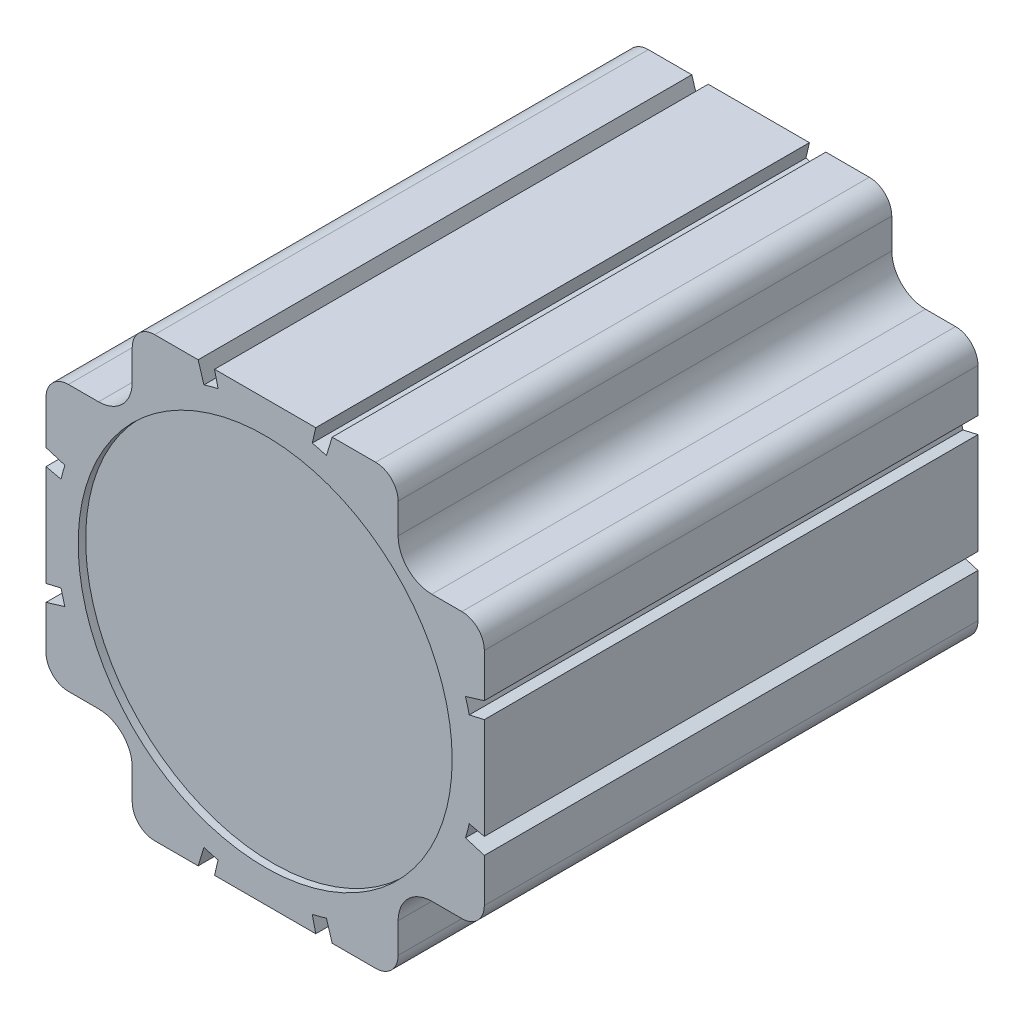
ISO-10303-21;
HEADER;
FILE_DESCRIPTION(('STEP AP214'),'2;1');
FILE_NAME('part.step','',(''),(''),'','','');
FILE_SCHEMA(('AUTOMOTIVE_DESIGN { 1 0 10303 214 1 1 1 1 }'));
ENDSEC;
DATA;
#1=APPLICATION_CONTEXT('core data for automotive mechanical design processes');
#2=APPLICATION_PROTOCOL_DEFINITION('international standard','automotive_design',2000,#1);
#3=PRODUCT_CONTEXT('',#1,'mechanical');
#4=PRODUCT('Part','Part','',(#3));
#5=PRODUCT_RELATED_PRODUCT_CATEGORY('part','',(#4));
#6=PRODUCT_DEFINITION_FORMATION('','',#4);
#7=PRODUCT_DEFINITION_CONTEXT('part definition',#1,'design');
#8=PRODUCT_DEFINITION('design','',#6,#7);
#9=PRODUCT_DEFINITION_SHAPE('','',#8);
#10=(LENGTH_UNIT() NAMED_UNIT(*) SI_UNIT(.MILLI.,.METRE.));
#11=(NAMED_UNIT(*) PLANE_ANGLE_UNIT() SI_UNIT($,.RADIAN.));
#12=(NAMED_UNIT(*) SI_UNIT($,.STERADIAN.) SOLID_ANGLE_UNIT());
#13=UNCERTAINTY_MEASURE_WITH_UNIT(LENGTH_MEASURE(1.E-05),#10,'distance_accuracy_value','');
#14=(GEOMETRIC_REPRESENTATION_CONTEXT(3) GLOBAL_UNCERTAINTY_ASSIGNED_CONTEXT((#13)) GLOBAL_UNIT_ASSIGNED_CONTEXT((#10,
#11,#12)) REPRESENTATION_CONTEXT('',''));
#15=CARTESIAN_POINT('',(0.,0.,0.));
#16=DIRECTION('',(0.,0.,1.));
#17=DIRECTION('',(1.,0.,0.));
#18=AXIS2_PLACEMENT_3D('',#15,#16,#17);
#19=CARTESIAN_POINT('',(-29.3,-29.3,66.));
#20=DIRECTION('',(0.,1.,0.));
#21=DIRECTION('',(0.,0.,1.));
#22=AXIS2_PLACEMENT_3D('',#19,#20,#21);
#23=PLANE('',#22);
#24=DIRECTION('',(1.,0.,0.));
#25=VECTOR('',#24,1.);
#26=CARTESIAN_POINT('',(-29.3,-29.3,66.));
#27=LINE('',#26,#25);
#28=CARTESIAN_POINT('',(8.95790896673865,-29.3,66.));
#29=VERTEX_POINT('',#28);
#30=CARTESIAN_POINT('',(14.7738636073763,-29.3,66.));
#31=VERTEX_POINT('',#30);
#32=EDGE_CURVE('E756',#29,#31,#27,.T.);
#33=ORIENTED_EDGE('',*,*,#32,.F.);
#34=DIRECTION('',(0.,0.,-1.));
#35=VECTOR('',#34,1.);
#36=CARTESIAN_POINT('',(8.95790896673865,-29.3,66.));
#37=LINE('',#36,#35);
#38=CARTESIAN_POINT('',(8.95790896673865,-29.3,0.));
#39=VERTEX_POINT('',#38);
#40=EDGE_CURVE('E403',#29,#39,#37,.T.);
#41=ORIENTED_EDGE('',*,*,#40,.T.);
#42=DIRECTION('',(1.,0.,0.));
#43=VECTOR('',#42,1.);
#44=CARTESIAN_POINT('',(-29.3,-29.3,0.));
#45=LINE('',#44,#43);
#46=CARTESIAN_POINT('',(14.7738636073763,-29.3,0.));
#47=VERTEX_POINT('',#46);
#48=EDGE_CURVE('E776',#39,#47,#45,.T.);
#49=ORIENTED_EDGE('',*,*,#48,.T.);
#50=DIRECTION('',(0.,0.,-1.));
#51=VECTOR('',#50,1.);
#52=CARTESIAN_POINT('',(14.7738636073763,-29.3,66.));
#53=LINE('',#52,#51);
#54=EDGE_CURVE('E716',#31,#47,#53,.T.);
#55=ORIENTED_EDGE('',*,*,#54,.F.);
#56=EDGE_LOOP('',(#33,#41,#49,#55));
#57=FACE_BOUND('',#56,.T.);
#58=ADVANCED_FACE('F17',(#57),#23,.F.);
#59=CARTESIAN_POINT('',(-29.3,29.3,66.));
#60=DIRECTION('',(1.,0.,0.));
#61=DIRECTION('',(0.,1.,0.));
#62=AXIS2_PLACEMENT_3D('',#59,#60,#61);
#63=PLANE('',#62);
#64=DIRECTION('',(0.,-1.,0.));
#65=VECTOR('',#64,1.);
#66=CARTESIAN_POINT('',(-29.3,29.3,66.));
#67=LINE('',#66,#65);
#68=CARTESIAN_POINT('',(-29.3,-8.95790896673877,66.));
#69=VERTEX_POINT('',#68);
#70=CARTESIAN_POINT('',(-29.3,-14.7738636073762,66.));
#71=VERTEX_POINT('',#70);
#72=EDGE_CURVE('E758',#69,#71,#67,.T.);
#73=ORIENTED_EDGE('',*,*,#72,.F.);
#74=DIRECTION('',(0.,0.,-1.));
#75=VECTOR('',#74,1.);
#76=CARTESIAN_POINT('',(-29.3,-8.95790896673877,66.));
#77=LINE('',#76,#75);
#78=CARTESIAN_POINT('',(-29.3,-8.95790896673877,0.));
#79=VERTEX_POINT('',#78);
#80=EDGE_CURVE('E424',#69,#79,#77,.T.);
#81=ORIENTED_EDGE('',*,*,#80,.T.);
#82=DIRECTION('',(0.,-1.,0.));
#83=VECTOR('',#82,1.);
#84=CARTESIAN_POINT('',(-29.3,29.3,0.));
#85=LINE('',#84,#83);
#86=CARTESIAN_POINT('',(-29.3,-14.7738636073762,0.));
#87=VERTEX_POINT('',#86);
#88=EDGE_CURVE('E695',#79,#87,#85,.T.);
#89=ORIENTED_EDGE('',*,*,#88,.T.);
#90=DIRECTION('',(0.,0.,-1.));
#91=VECTOR('',#90,1.);
#92=CARTESIAN_POINT('',(-29.3,-14.7738636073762,66.));
#93=LINE('',#92,#91);
#94=EDGE_CURVE('E701',#71,#87,#93,.T.);
#95=ORIENTED_EDGE('',*,*,#94,.F.);
#96=EDGE_LOOP('',(#73,#81,#89,#95));
#97=FACE_BOUND('',#96,.T.);
#98=ADVANCED_FACE('F819',(#97),#63,.F.);
#99=CARTESIAN_POINT('',(29.3,29.3,66.));
#100=DIRECTION('',(-1.,0.,0.));
#101=DIRECTION('',(0.,-1.,0.));
#102=AXIS2_PLACEMENT_3D('',#99,#100,#101);
#103=PLANE('',#102);
#104=DIRECTION('',(0.,1.,0.));
#105=VECTOR('',#104,1.);
#106=CARTESIAN_POINT('',(29.3,29.3,66.));
#107=LINE('',#106,#105);
#108=CARTESIAN_POINT('',(29.3,-6.76443799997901,66.));
#109=VERTEX_POINT('',#108);
#110=CARTESIAN_POINT('',(29.3,6.76443799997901,66.));
#111=VERTEX_POINT('',#110);
#112=EDGE_CURVE('E767',#109,#111,#107,.T.);
#113=ORIENTED_EDGE('',*,*,#112,.F.);
#114=DIRECTION('',(0.,0.,-1.));
#115=VECTOR('',#114,1.);
#116=CARTESIAN_POINT('',(29.3,-6.76443799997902,66.));
#117=LINE('',#116,#115);
#118=CARTESIAN_POINT('',(29.3,-6.76443799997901,0.));
#119=VERTEX_POINT('',#118);
#120=EDGE_CURVE('E448',#109,#119,#117,.T.);
#121=ORIENTED_EDGE('',*,*,#120,.T.);
#122=DIRECTION('',(0.,1.,0.));
#123=VECTOR('',#122,1.);
#124=CARTESIAN_POINT('',(29.3,29.3,0.));
#125=LINE('',#124,#123);
#126=CARTESIAN_POINT('',(29.3,6.76443799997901,0.));
#127=VERTEX_POINT('',#126);
#128=EDGE_CURVE('E787',#119,#127,#125,.T.);
#129=ORIENTED_EDGE('',*,*,#128,.T.);
#130=DIRECTION('',(0.,0.,1.));
#131=VECTOR('',#130,1.);
#132=CARTESIAN_POINT('',(29.3,6.76443799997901,66.));
#133=LINE('',#132,#131);
#134=EDGE_CURVE('E545',#127,#111,#133,.T.);
#135=ORIENTED_EDGE('',*,*,#134,.T.);
#136=EDGE_LOOP('',(#113,#121,#129,#135));
#137=FACE_BOUND('',#136,.T.);
#138=ADVANCED_FACE('F856',(#137),#103,.F.);
#139=CARTESIAN_POINT('',(-6.7644379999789,-29.3,0.));
#140=VERTEX_POINT('',#139);
#141=CARTESIAN_POINT('',(6.76443799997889,-29.3,0.));
#142=VERTEX_POINT('',#141);
#143=EDGE_CURVE('E782',#140,#142,#45,.T.);
#144=ORIENTED_EDGE('',*,*,#143,.T.);
#145=DIRECTION('',(0.,0.,1.));
#146=VECTOR('',#145,1.);
#147=CARTESIAN_POINT('',(6.76443799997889,-29.3,66.));
#148=LINE('',#147,#146);
#149=CARTESIAN_POINT('',(6.7644379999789,-29.3,66.));
#150=VERTEX_POINT('',#149);
#151=EDGE_CURVE('E32',#142,#150,#148,.T.);
#152=ORIENTED_EDGE('',*,*,#151,.T.);
#153=CARTESIAN_POINT('',(-6.7644379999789,-29.3,66.));
#154=VERTEX_POINT('',#153);
#155=EDGE_CURVE('E392',#154,#150,#27,.T.);
#156=ORIENTED_EDGE('',*,*,#155,.F.);
#157=DIRECTION('',(0.,0.,-1.));
#158=VECTOR('',#157,1.);
#159=CARTESIAN_POINT('',(-6.7644379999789,-29.3,66.));
#160=LINE('',#159,#158);
#161=EDGE_CURVE('E472',#154,#140,#160,.T.);
#162=ORIENTED_EDGE('',*,*,#161,.T.);
#163=EDGE_LOOP('',(#144,#152,#156,#162));
#164=FACE_BOUND('',#163,.T.);
#165=ADVANCED_FACE('F850',(#164),#23,.F.);
#166=CARTESIAN_POINT('',(-29.3,29.3,66.));
#167=DIRECTION('',(0.,-1.,0.));
#168=DIRECTION('',(0.,0.,-1.));
#169=AXIS2_PLACEMENT_3D('',#166,#167,#168);
#170=PLANE('',#169);
#171=DIRECTION('',(-1.,0.,0.));
#172=VECTOR('',#171,1.);
#173=CARTESIAN_POINT('',(-29.3,29.3,66.));
#174=LINE('',#173,#172);
#175=CARTESIAN_POINT('',(-8.95790896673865,29.3,66.));
#176=VERTEX_POINT('',#175);
#177=CARTESIAN_POINT('',(-14.7738636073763,29.3,66.));
#178=VERTEX_POINT('',#177);
#179=EDGE_CURVE('E766',#176,#178,#174,.T.);
#180=ORIENTED_EDGE('',*,*,#179,.F.);
#181=DIRECTION('',(0.,0.,-1.));
#182=VECTOR('',#181,1.);
#183=CARTESIAN_POINT('',(-8.95790896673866,29.3,66.));
#184=LINE('',#183,#182);
#185=CARTESIAN_POINT('',(-8.95790896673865,29.3,0.));
#186=VERTEX_POINT('',#185);
#187=EDGE_CURVE('E496',#176,#186,#184,.T.);
#188=ORIENTED_EDGE('',*,*,#187,.T.);
#189=DIRECTION('',(-1.,0.,0.));
#190=VECTOR('',#189,1.);
#191=CARTESIAN_POINT('',(-29.3,29.3,0.));
#192=LINE('',#191,#190);
#193=CARTESIAN_POINT('',(-14.7738636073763,29.3,0.));
#194=VERTEX_POINT('',#193);
#195=EDGE_CURVE('E786',#186,#194,#192,.T.);
#196=ORIENTED_EDGE('',*,*,#195,.T.);
#197=DIRECTION('',(0.,0.,-1.));
#198=VECTOR('',#197,1.);
#199=CARTESIAN_POINT('',(-14.7738636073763,29.3,66.));
#200=LINE('',#199,#198);
#201=EDGE_CURVE('E746',#178,#194,#200,.T.);
#202=ORIENTED_EDGE('',*,*,#201,.F.);
#203=EDGE_LOOP('',(#180,#188,#196,#202));
#204=FACE_BOUND('',#203,.T.);
#205=ADVANCED_FACE('F860',(#204),#170,.F.);
#206=CARTESIAN_POINT('',(-29.3,6.76443799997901,0.));
#207=VERTEX_POINT('',#206);
#208=CARTESIAN_POINT('',(-29.3,-6.764437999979,0.));
#209=VERTEX_POINT('',#208);
#210=EDGE_CURVE('E777',#207,#209,#85,.T.);
#211=ORIENTED_EDGE('',*,*,#210,.T.);
#212=DIRECTION('',(0.,0.,1.));
#213=VECTOR('',#212,1.);
#214=CARTESIAN_POINT('',(-29.3,-6.76443799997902,66.));
#215=LINE('',#214,#213);
#216=CARTESIAN_POINT('',(-29.3,-6.76443799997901,66.));
#217=VERTEX_POINT('',#216);
#218=EDGE_CURVE('E40',#209,#217,#215,.T.);
#219=ORIENTED_EDGE('',*,*,#218,.T.);
#220=CARTESIAN_POINT('',(-29.3,6.76443799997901,66.));
#221=VERTEX_POINT('',#220);
#222=EDGE_CURVE('E757',#221,#217,#67,.T.);
#223=ORIENTED_EDGE('',*,*,#222,.F.);
#224=DIRECTION('',(0.,0.,-1.));
#225=VECTOR('',#224,1.);
#226=CARTESIAN_POINT('',(-29.3,6.76443799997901,66.));
#227=LINE('',#226,#225);
#228=EDGE_CURVE('E520',#221,#207,#227,.T.);
#229=ORIENTED_EDGE('',*,*,#228,.T.);
#230=EDGE_LOOP('',(#211,#219,#223,#229));
#231=FACE_BOUND('',#230,.T.);
#232=ADVANCED_FACE('F830',(#231),#63,.F.);
#233=CARTESIAN_POINT('',(29.3,-14.7738636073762,0.));
#234=VERTEX_POINT('',#233);
#235=CARTESIAN_POINT('',(29.3,-8.95790896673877,0.));
#236=VERTEX_POINT('',#235);
#237=EDGE_CURVE('E783',#234,#236,#125,.T.);
#238=ORIENTED_EDGE('',*,*,#237,.T.);
#239=DIRECTION('',(0.,0.,1.));
#240=VECTOR('',#239,1.);
#241=CARTESIAN_POINT('',(29.3,-8.95790896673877,66.));
#242=LINE('',#241,#240);
#243=CARTESIAN_POINT('',(29.3,-8.95790896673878,66.));
#244=VERTEX_POINT('',#243);
#245=EDGE_CURVE('E444',#236,#244,#242,.T.);
#246=ORIENTED_EDGE('',*,*,#245,.T.);
#247=CARTESIAN_POINT('',(29.3,-14.7738636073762,66.));
#248=VERTEX_POINT('',#247);
#249=EDGE_CURVE('E763',#248,#244,#107,.T.);
#250=ORIENTED_EDGE('',*,*,#249,.F.);
#251=DIRECTION('',(0.,0.,-1.));
#252=VECTOR('',#251,1.);
#253=CARTESIAN_POINT('',(29.3,-14.7738636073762,66.));
#254=LINE('',#253,#252);
#255=EDGE_CURVE('E728',#248,#234,#254,.T.);
#256=ORIENTED_EDGE('',*,*,#255,.T.);
#257=EDGE_LOOP('',(#238,#246,#250,#256));
#258=FACE_BOUND('',#257,.T.);
#259=ADVANCED_FACE('F872',(#258),#103,.F.);
#260=CARTESIAN_POINT('',(6.7644379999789,29.3,0.));
#261=VERTEX_POINT('',#260);
#262=CARTESIAN_POINT('',(-6.7644379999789,29.3,0.));
#263=VERTEX_POINT('',#262);
#264=EDGE_CURVE('E791',#261,#263,#192,.T.);
#265=ORIENTED_EDGE('',*,*,#264,.T.);
#266=DIRECTION('',(0.,0.,1.));
#267=VECTOR('',#266,1.);
#268=CARTESIAN_POINT('',(-6.7644379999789,29.3,66.));
#269=LINE('',#268,#267);
#270=CARTESIAN_POINT('',(-6.7644379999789,29.3,66.));
#271=VERTEX_POINT('',#270);
#272=EDGE_CURVE('E492',#263,#271,#269,.T.);
#273=ORIENTED_EDGE('',*,*,#272,.T.);
#274=CARTESIAN_POINT('',(6.7644379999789,29.3,66.));
#275=VERTEX_POINT('',#274);
#276=EDGE_CURVE('E772',#275,#271,#174,.T.);
#277=ORIENTED_EDGE('',*,*,#276,.F.);
#278=DIRECTION('',(0.,0.,-1.));
#279=VECTOR('',#278,1.);
#280=CARTESIAN_POINT('',(6.7644379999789,29.3,66.));
#281=LINE('',#280,#279);
#282=EDGE_CURVE('E569',#275,#261,#281,.T.);
#283=ORIENTED_EDGE('',*,*,#282,.T.);
#284=EDGE_LOOP('',(#265,#273,#277,#283));
#285=FACE_BOUND('',#284,.T.);
#286=ADVANCED_FACE('F873',(#285),#170,.F.);
#287=CARTESIAN_POINT('',(-29.3,14.7738636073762,0.));
#288=VERTEX_POINT('',#287);
#289=CARTESIAN_POINT('',(-29.3,8.95790896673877,0.));
#290=VERTEX_POINT('',#289);
#291=EDGE_CURVE('E773',#288,#290,#85,.T.);
#292=ORIENTED_EDGE('',*,*,#291,.T.);
#293=DIRECTION('',(0.,0.,1.));
#294=VECTOR('',#293,1.);
#295=CARTESIAN_POINT('',(-29.3,8.95790896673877,66.));
#296=LINE('',#295,#294);
#297=CARTESIAN_POINT('',(-29.3,8.95790896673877,66.));
#298=VERTEX_POINT('',#297);
#299=EDGE_CURVE('E516',#290,#298,#296,.T.);
#300=ORIENTED_EDGE('',*,*,#299,.T.);
#301=CARTESIAN_POINT('',(-29.3,14.7738636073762,66.));
#302=VERTEX_POINT('',#301);
#303=EDGE_CURVE('E753',#302,#298,#67,.T.);
#304=ORIENTED_EDGE('',*,*,#303,.F.);
#305=DIRECTION('',(0.,0.,-1.));
#306=VECTOR('',#305,1.);
#307=CARTESIAN_POINT('',(-29.3,14.7738636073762,66.));
#308=LINE('',#307,#306);
#309=EDGE_CURVE('E698',#302,#288,#308,.T.);
#310=ORIENTED_EDGE('',*,*,#309,.T.);
#311=EDGE_LOOP('',(#292,#300,#304,#310));
#312=FACE_BOUND('',#311,.T.);
#313=ADVANCED_FACE('F19',(#312),#63,.F.);
#314=CARTESIAN_POINT('',(-14.7738636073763,-29.3,0.));
#315=VERTEX_POINT('',#314);
#316=CARTESIAN_POINT('',(-8.95790896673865,-29.3,0.));
#317=VERTEX_POINT('',#316);
#318=EDGE_CURVE('E778',#315,#317,#45,.T.);
#319=ORIENTED_EDGE('',*,*,#318,.T.);
#320=DIRECTION('',(0.,0.,1.));
#321=VECTOR('',#320,1.);
#322=CARTESIAN_POINT('',(-8.95790896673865,-29.3,66.));
#323=LINE('',#322,#321);
#324=CARTESIAN_POINT('',(-8.95790896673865,-29.3,66.));
#325=VERTEX_POINT('',#324);
#326=EDGE_CURVE('E468',#317,#325,#323,.T.);
#327=ORIENTED_EDGE('',*,*,#326,.T.);
#328=CARTESIAN_POINT('',(-14.7738636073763,-29.3,66.));
#329=VERTEX_POINT('',#328);
#330=EDGE_CURVE('E759',#329,#325,#27,.T.);
#331=ORIENTED_EDGE('',*,*,#330,.F.);
#332=DIRECTION('',(0.,0.,-1.));
#333=VECTOR('',#332,1.);
#334=CARTESIAN_POINT('',(-14.7738636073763,-29.3,66.));
#335=LINE('',#334,#333);
#336=EDGE_CURVE('E713',#329,#315,#335,.T.);
#337=ORIENTED_EDGE('',*,*,#336,.T.);
#338=EDGE_LOOP('',(#319,#327,#331,#337));
#339=FACE_BOUND('',#338,.T.);
#340=ADVANCED_FACE('F851',(#339),#23,.F.);
#341=CARTESIAN_POINT('',(29.3,8.95790896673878,66.));
#342=VERTEX_POINT('',#341);
#343=CARTESIAN_POINT('',(29.3,14.7738636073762,66.));
#344=VERTEX_POINT('',#343);
#345=EDGE_CURVE('E762',#342,#344,#107,.T.);
#346=ORIENTED_EDGE('',*,*,#345,.F.);
#347=DIRECTION('',(0.,0.,-1.));
#348=VECTOR('',#347,1.);
#349=CARTESIAN_POINT('',(29.3,8.95790896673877,66.));
#350=LINE('',#349,#348);
#351=CARTESIAN_POINT('',(29.3,8.95790896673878,0.));
#352=VERTEX_POINT('',#351);
#353=EDGE_CURVE('E540',#342,#352,#350,.T.);
#354=ORIENTED_EDGE('',*,*,#353,.T.);
#355=CARTESIAN_POINT('',(29.3,14.7738636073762,0.));
#356=VERTEX_POINT('',#355);
#357=EDGE_CURVE('E781',#352,#356,#125,.T.);
#358=ORIENTED_EDGE('',*,*,#357,.T.);
#359=DIRECTION('',(0.,0.,-1.));
#360=VECTOR('',#359,1.);
#361=CARTESIAN_POINT('',(29.3,14.7738636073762,66.));
#362=LINE('',#361,#360);
#363=EDGE_CURVE('E731',#344,#356,#362,.T.);
#364=ORIENTED_EDGE('',*,*,#363,.F.);
#365=EDGE_LOOP('',(#346,#354,#358,#364));
#366=FACE_BOUND('',#365,.T.);
#367=ADVANCED_FACE('F863',(#366),#103,.F.);
#368=CARTESIAN_POINT('',(14.7738636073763,29.3,0.));
#369=VERTEX_POINT('',#368);
#370=CARTESIAN_POINT('',(8.95790896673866,29.3,0.));
#371=VERTEX_POINT('',#370);
#372=EDGE_CURVE('E788',#369,#371,#192,.T.);
#373=ORIENTED_EDGE('',*,*,#372,.T.);
#374=DIRECTION('',(0.,0.,1.));
#375=VECTOR('',#374,1.);
#376=CARTESIAN_POINT('',(8.95790896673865,29.3,66.));
#377=LINE('',#376,#375);
#378=CARTESIAN_POINT('',(8.95790896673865,29.3,66.));
#379=VERTEX_POINT('',#378);
#380=EDGE_CURVE('E565',#371,#379,#377,.T.);
#381=ORIENTED_EDGE('',*,*,#380,.T.);
#382=CARTESIAN_POINT('',(14.7738636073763,29.3,66.));
#383=VERTEX_POINT('',#382);
#384=EDGE_CURVE('E768',#383,#379,#174,.T.);
#385=ORIENTED_EDGE('',*,*,#384,.F.);
#386=DIRECTION('',(0.,0.,-1.));
#387=VECTOR('',#386,1.);
#388=CARTESIAN_POINT('',(14.7738636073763,29.3,66.));
#389=LINE('',#388,#387);
#390=EDGE_CURVE('E743',#383,#369,#389,.T.);
#391=ORIENTED_EDGE('',*,*,#390,.T.);
#392=EDGE_LOOP('',(#373,#381,#385,#391));
#393=FACE_BOUND('',#392,.T.);
#394=ADVANCED_FACE('F870',(#393),#170,.F.);
#395=CARTESIAN_POINT('',(-29.3,-29.3,66.));
#396=DIRECTION('',(0.,0.,1.));
#397=DIRECTION('',(1.,0.,0.));
#398=AXIS2_PLACEMENT_3D('',#395,#396,#397);
#399=PLANE('',#398);
#400=CARTESIAN_POINT('',(0.,0.,66.));
#401=DIRECTION('',(0.,0.,1.));
#402=DIRECTION('',(1.,0.,0.));
#403=AXIS2_PLACEMENT_3D('',#400,#401,#402);
#404=CIRCLE('',#403,25.);
#405=CARTESIAN_POINT('',(25.,0.,66.));
#406=VERTEX_POINT('',#405);
#407=EDGE_CURVE('E1518',#406,#406,#404,.T.);
#408=ORIENTED_EDGE('',*,*,#407,.F.);
#409=EDGE_LOOP('',(#408));
#410=FACE_BOUND('',#409,.T.);
#411=DIRECTION('',(-0.292371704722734,0.956304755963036,0.));
#412=VECTOR('',#411,1.);
#413=CARTESIAN_POINT('',(8.18640773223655,-26.776533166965,66.));
#414=LINE('',#413,#412);
#415=CARTESIAN_POINT('',(8.18640773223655,-26.776533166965,66.));
#416=VERTEX_POINT('',#415);
#417=EDGE_CURVE('E393',#29,#416,#414,.T.);
#418=ORIENTED_EDGE('',*,*,#417,.F.);
#419=ORIENTED_EDGE('',*,*,#32,.T.);
#420=CARTESIAN_POINT('',(14.7738636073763,-26.3,66.));
#421=DIRECTION('',(0.,0.,-1.));
#422=DIRECTION('',(-1.,0.,0.));
#423=AXIS2_PLACEMENT_3D('',#420,#421,#422);
#424=CIRCLE('',#423,3.);
#425=CARTESIAN_POINT('',(17.7738636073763,-26.3,66.));
#426=VERTEX_POINT('',#425);
#427=EDGE_CURVE('E610',#426,#31,#424,.T.);
#428=ORIENTED_EDGE('',*,*,#427,.F.);
#429=DIRECTION('',(0.,-1.,0.));
#430=VECTOR('',#429,1.);
#431=CARTESIAN_POINT('',(17.7738636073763,-22.2738636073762,66.));
#432=LINE('',#431,#430);
#433=CARTESIAN_POINT('',(17.7738636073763,-22.2738636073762,66.));
#434=VERTEX_POINT('',#433);
#435=EDGE_CURVE('E607',#434,#426,#432,.T.);
#436=ORIENTED_EDGE('',*,*,#435,.F.);
#437=CARTESIAN_POINT('',(22.2738636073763,-22.2738636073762,66.));
#438=DIRECTION('',(0.,0.,1.));
#439=DIRECTION('',(-1.,0.,0.));
#440=AXIS2_PLACEMENT_3D('',#437,#438,#439);
#441=CIRCLE('',#440,4.5);
#442=CARTESIAN_POINT('',(22.2738636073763,-17.7738636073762,66.));
#443=VERTEX_POINT('',#442);
#444=EDGE_CURVE('E604',#443,#434,#441,.T.);
#445=ORIENTED_EDGE('',*,*,#444,.F.);
#446=DIRECTION('',(-1.,0.,0.));
#447=VECTOR('',#446,1.);
#448=CARTESIAN_POINT('',(22.2738636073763,-17.7738636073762,66.));
#449=LINE('',#448,#447);
#450=CARTESIAN_POINT('',(26.3,-17.7738636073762,66.));
#451=VERTEX_POINT('',#450);
#452=EDGE_CURVE('E601',#451,#443,#449,.T.);
#453=ORIENTED_EDGE('',*,*,#452,.F.);
#454=CARTESIAN_POINT('',(26.3,-14.7738636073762,66.));
#455=DIRECTION('',(0.,0.,-1.));
#456=DIRECTION('',(-1.,0.,0.));
#457=AXIS2_PLACEMENT_3D('',#454,#455,#456);
#458=CIRCLE('',#457,3.);
#459=EDGE_CURVE('E598',#248,#451,#458,.T.);
#460=ORIENTED_EDGE('',*,*,#459,.F.);
#461=ORIENTED_EDGE('',*,*,#249,.T.);
#462=DIRECTION('',(0.956304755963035,-0.292371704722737,0.));
#463=VECTOR('',#462,1.);
#464=CARTESIAN_POINT('',(26.776533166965,-8.18640773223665,66.));
#465=LINE('',#464,#463);
#466=CARTESIAN_POINT('',(26.776533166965,-8.18640773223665,66.));
#467=VERTEX_POINT('',#466);
#468=EDGE_CURVE('E430',#467,#244,#465,.T.);
#469=ORIENTED_EDGE('',*,*,#468,.F.);
#470=CARTESIAN_POINT('',(0.,0.,66.));
#471=DIRECTION('',(0.,0.,-1.));
#472=DIRECTION('',(-1.,0.,0.));
#473=AXIS2_PLACEMENT_3D('',#470,#471,#472);
#474=CIRCLE('',#473,28.);
#475=CARTESIAN_POINT('',(27.2823618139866,-6.29862952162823,66.));
#476=VERTEX_POINT('',#475);
#477=EDGE_CURVE('E427',#476,#467,#474,.T.);
#478=ORIENTED_EDGE('',*,*,#477,.F.);
#479=DIRECTION('',(-0.974370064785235,0.224951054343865,0.));
#480=VECTOR('',#479,1.);
#481=CARTESIAN_POINT('',(27.2823618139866,-6.29862952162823,66.));
#482=LINE('',#481,#480);
#483=EDGE_CURVE('E432',#109,#476,#482,.T.);
#484=ORIENTED_EDGE('',*,*,#483,.F.);
#485=ORIENTED_EDGE('',*,*,#112,.T.);
#486=DIRECTION('',(0.974370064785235,0.224951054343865,0.));
#487=VECTOR('',#486,1.);
#488=CARTESIAN_POINT('',(27.2823618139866,6.29862952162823,66.));
#489=LINE('',#488,#487);
#490=CARTESIAN_POINT('',(27.2823618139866,6.29862952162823,66.));
#491=VERTEX_POINT('',#490);
#492=EDGE_CURVE('E528',#491,#111,#489,.T.);
#493=ORIENTED_EDGE('',*,*,#492,.F.);
#494=CARTESIAN_POINT('',(0.,0.,66.));
#495=DIRECTION('',(0.,0.,-1.));
#496=DIRECTION('',(1.,0.,0.));
#497=AXIS2_PLACEMENT_3D('',#494,#495,#496);
#498=CIRCLE('',#497,28.);
#499=CARTESIAN_POINT('',(26.776533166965,8.18640773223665,66.));
#500=VERTEX_POINT('',#499);
#501=EDGE_CURVE('E525',#500,#491,#498,.T.);
#502=ORIENTED_EDGE('',*,*,#501,.F.);
#503=DIRECTION('',(-0.956304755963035,-0.292371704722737,0.));
#504=VECTOR('',#503,1.);
#505=CARTESIAN_POINT('',(26.776533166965,8.18640773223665,66.));
#506=LINE('',#505,#504);
#507=EDGE_CURVE('E523',#342,#500,#506,.T.);
#508=ORIENTED_EDGE('',*,*,#507,.F.);
#509=ORIENTED_EDGE('',*,*,#345,.T.);
#510=CARTESIAN_POINT('',(26.3,14.7738636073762,66.));
#511=DIRECTION('',(0.,0.,-1.));
#512=DIRECTION('',(1.,0.,0.));
#513=AXIS2_PLACEMENT_3D('',#510,#511,#512);
#514=CIRCLE('',#513,3.);
#515=CARTESIAN_POINT('',(26.3,17.7738636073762,66.));
#516=VERTEX_POINT('',#515);
#517=EDGE_CURVE('E595',#516,#344,#514,.T.);
#518=ORIENTED_EDGE('',*,*,#517,.F.);
#519=DIRECTION('',(1.,0.,0.));
#520=VECTOR('',#519,1.);
#521=CARTESIAN_POINT('',(22.2738636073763,17.7738636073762,66.));
#522=LINE('',#521,#520);
#523=CARTESIAN_POINT('',(22.2738636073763,17.7738636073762,66.));
#524=VERTEX_POINT('',#523);
#525=EDGE_CURVE('E592',#524,#516,#522,.T.);
#526=ORIENTED_EDGE('',*,*,#525,.F.);
#527=CARTESIAN_POINT('',(22.2738636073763,22.2738636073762,66.));
#528=DIRECTION('',(0.,0.,1.));
#529=DIRECTION('',(1.,0.,0.));
#530=AXIS2_PLACEMENT_3D('',#527,#528,#529);
#531=CIRCLE('',#530,4.5);
#532=CARTESIAN_POINT('',(17.7738636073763,22.2738636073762,66.));
#533=VERTEX_POINT('',#532);
#534=EDGE_CURVE('E589',#533,#524,#531,.T.);
#535=ORIENTED_EDGE('',*,*,#534,.F.);
#536=DIRECTION('',(0.,-1.,0.));
#537=VECTOR('',#536,1.);
#538=CARTESIAN_POINT('',(17.7738636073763,22.2738636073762,66.));
#539=LINE('',#538,#537);
#540=CARTESIAN_POINT('',(17.7738636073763,26.3,66.));
#541=VERTEX_POINT('',#540);
#542=EDGE_CURVE('E586',#541,#533,#539,.T.);
#543=ORIENTED_EDGE('',*,*,#542,.F.);
#544=CARTESIAN_POINT('',(14.7738636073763,26.3,66.));
#545=DIRECTION('',(0.,0.,-1.));
#546=DIRECTION('',(1.,0.,0.));
#547=AXIS2_PLACEMENT_3D('',#544,#545,#546);
#548=CIRCLE('',#547,3.);
#549=EDGE_CURVE('E583',#383,#541,#548,.T.);
#550=ORIENTED_EDGE('',*,*,#549,.F.);
#551=ORIENTED_EDGE('',*,*,#384,.T.);
#552=DIRECTION('',(0.292371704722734,0.956304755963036,0.));
#553=VECTOR('',#552,1.);
#554=CARTESIAN_POINT('',(8.18640773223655,26.776533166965,66.));
#555=LINE('',#554,#553);
#556=CARTESIAN_POINT('',(8.18640773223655,26.776533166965,66.));
#557=VERTEX_POINT('',#556);
#558=EDGE_CURVE('E551',#557,#379,#555,.T.);
#559=ORIENTED_EDGE('',*,*,#558,.F.);
#560=CARTESIAN_POINT('',(0.,0.,66.));
#561=DIRECTION('',(0.,0.,-1.));
#562=DIRECTION('',(-1.,0.,0.));
#563=AXIS2_PLACEMENT_3D('',#560,#561,#562);
#564=CIRCLE('',#563,28.);
#565=CARTESIAN_POINT('',(6.29862952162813,27.2823618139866,66.));
#566=VERTEX_POINT('',#565);
#567=EDGE_CURVE('E548',#566,#557,#564,.T.);
#568=ORIENTED_EDGE('',*,*,#567,.F.);
#569=DIRECTION('',(-0.224951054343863,-0.974370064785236,0.));
#570=VECTOR('',#569,1.);
#571=CARTESIAN_POINT('',(6.29862952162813,27.2823618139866,66.));
#572=LINE('',#571,#570);
#573=EDGE_CURVE('E553',#275,#566,#572,.T.);
#574=ORIENTED_EDGE('',*,*,#573,.F.);
#575=ORIENTED_EDGE('',*,*,#276,.T.);
#576=DIRECTION('',(-0.224951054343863,0.974370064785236,0.));
#577=VECTOR('',#576,1.);
#578=CARTESIAN_POINT('',(-6.29862952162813,27.2823618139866,66.));
#579=LINE('',#578,#577);
#580=CARTESIAN_POINT('',(-6.29862952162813,27.2823618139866,66.));
#581=VERTEX_POINT('',#580);
#582=EDGE_CURVE('E478',#581,#271,#579,.T.);
#583=ORIENTED_EDGE('',*,*,#582,.F.);
#584=CARTESIAN_POINT('',(0.,0.,66.));
#585=DIRECTION('',(0.,0.,-1.));
#586=DIRECTION('',(1.,0.,0.));
#587=AXIS2_PLACEMENT_3D('',#584,#585,#586);
#588=CIRCLE('',#587,28.);
#589=CARTESIAN_POINT('',(-8.18640773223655,26.776533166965,66.));
#590=VERTEX_POINT('',#589);
#591=EDGE_CURVE('E475',#590,#581,#588,.T.);
#592=ORIENTED_EDGE('',*,*,#591,.F.);
#593=DIRECTION('',(0.292371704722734,-0.956304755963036,0.));
#594=VECTOR('',#593,1.);
#595=CARTESIAN_POINT('',(-8.18640773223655,26.776533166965,66.));
#596=LINE('',#595,#594);
#597=EDGE_CURVE('E480',#176,#590,#596,.T.);
#598=ORIENTED_EDGE('',*,*,#597,.F.);
#599=ORIENTED_EDGE('',*,*,#179,.T.);
#600=CARTESIAN_POINT('',(-14.7738636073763,26.3,66.));
#601=DIRECTION('',(0.,0.,-1.));
#602=DIRECTION('',(-1.,0.,0.));
#603=AXIS2_PLACEMENT_3D('',#600,#601,#602);
#604=CIRCLE('',#603,3.);
#605=CARTESIAN_POINT('',(-17.7738636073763,26.3,66.));
#606=VERTEX_POINT('',#605);
#607=EDGE_CURVE('E580',#606,#178,#604,.T.);
#608=ORIENTED_EDGE('',*,*,#607,.F.);
#609=DIRECTION('',(0.,1.,0.));
#610=VECTOR('',#609,1.);
#611=CARTESIAN_POINT('',(-17.7738636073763,22.2738636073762,66.));
#612=LINE('',#611,#610);
#613=CARTESIAN_POINT('',(-17.7738636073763,22.2738636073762,66.));
#614=VERTEX_POINT('',#613);
#615=EDGE_CURVE('E576',#614,#606,#612,.T.);
#616=ORIENTED_EDGE('',*,*,#615,.F.);
#617=CARTESIAN_POINT('',(-22.2738636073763,22.2738636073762,66.));
#618=DIRECTION('',(0.,0.,1.));
#619=DIRECTION('',(-1.,0.,0.));
#620=AXIS2_PLACEMENT_3D('',#617,#618,#619);
#621=CIRCLE('',#620,4.5);
#622=CARTESIAN_POINT('',(-22.2738636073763,17.7738636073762,66.));
#623=VERTEX_POINT('',#622);
#624=EDGE_CURVE('E573',#623,#614,#621,.T.);
#625=ORIENTED_EDGE('',*,*,#624,.F.);
#626=DIRECTION('',(1.,0.,0.));
#627=VECTOR('',#626,1.);
#628=CARTESIAN_POINT('',(-22.2738636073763,17.7738636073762,66.));
#629=LINE('',#628,#627);
#630=CARTESIAN_POINT('',(-26.3,17.7738636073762,66.));
#631=VERTEX_POINT('',#630);
#632=EDGE_CURVE('E631',#631,#623,#629,.T.);
#633=ORIENTED_EDGE('',*,*,#632,.F.);
#634=CARTESIAN_POINT('',(-26.3,14.7738636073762,66.));
#635=DIRECTION('',(0.,0.,-1.));
#636=DIRECTION('',(-1.,0.,0.));
#637=AXIS2_PLACEMENT_3D('',#634,#635,#636);
#638=CIRCLE('',#637,3.);
#639=EDGE_CURVE('E628',#302,#631,#638,.T.);
#640=ORIENTED_EDGE('',*,*,#639,.F.);
#641=ORIENTED_EDGE('',*,*,#303,.T.);
#642=DIRECTION('',(-0.956304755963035,0.292371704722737,0.));
#643=VECTOR('',#642,1.);
#644=CARTESIAN_POINT('',(-26.776533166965,8.18640773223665,66.));
#645=LINE('',#644,#643);
#646=CARTESIAN_POINT('',(-26.776533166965,8.18640773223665,66.));
#647=VERTEX_POINT('',#646);
#648=EDGE_CURVE('E502',#647,#298,#645,.T.);
#649=ORIENTED_EDGE('',*,*,#648,.F.);
#650=CARTESIAN_POINT('',(0.,0.,66.));
#651=DIRECTION('',(0.,0.,-1.));
#652=DIRECTION('',(-1.,0.,0.));
#653=AXIS2_PLACEMENT_3D('',#650,#651,#652);
#654=CIRCLE('',#653,28.);
#655=CARTESIAN_POINT('',(-27.2823618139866,6.29862952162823,66.));
#656=VERTEX_POINT('',#655);
#657=EDGE_CURVE('E499',#656,#647,#654,.T.);
#658=ORIENTED_EDGE('',*,*,#657,.F.);
#659=DIRECTION('',(0.974370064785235,-0.224951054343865,0.));
#660=VECTOR('',#659,1.);
#661=CARTESIAN_POINT('',(-27.2823618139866,6.29862952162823,66.));
#662=LINE('',#661,#660);
#663=EDGE_CURVE('E504',#221,#656,#662,.T.);
#664=ORIENTED_EDGE('',*,*,#663,.F.);
#665=ORIENTED_EDGE('',*,*,#222,.T.);
#666=DIRECTION('',(-0.974370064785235,-0.224951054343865,0.));
#667=VECTOR('',#666,1.);
#668=CARTESIAN_POINT('',(-27.2823618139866,-6.29862952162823,66.));
#669=LINE('',#668,#667);
#670=CARTESIAN_POINT('',(-27.2823618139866,-6.29862952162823,66.));
#671=VERTEX_POINT('',#670);
#672=EDGE_CURVE('E409',#671,#217,#669,.T.);
#673=ORIENTED_EDGE('',*,*,#672,.F.);
#674=CARTESIAN_POINT('',(0.,0.,66.));
#675=DIRECTION('',(0.,0.,-1.));
#676=DIRECTION('',(1.,0.,0.));
#677=AXIS2_PLACEMENT_3D('',#674,#675,#676);
#678=CIRCLE('',#677,28.);
#679=CARTESIAN_POINT('',(-26.776533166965,-8.18640773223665,66.));
#680=VERTEX_POINT('',#679);
#681=EDGE_CURVE('E406',#680,#671,#678,.T.);
#682=ORIENTED_EDGE('',*,*,#681,.F.);
#683=DIRECTION('',(0.956304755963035,0.292371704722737,0.));
#684=VECTOR('',#683,1.);
#685=CARTESIAN_POINT('',(-26.776533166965,-8.18640773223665,66.));
#686=LINE('',#685,#684);
#687=EDGE_CURVE('E411',#69,#680,#686,.T.);
#688=ORIENTED_EDGE('',*,*,#687,.F.);
#689=ORIENTED_EDGE('',*,*,#72,.T.);
#690=CARTESIAN_POINT('',(-26.3,-14.7738636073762,66.));
#691=DIRECTION('',(0.,0.,-1.));
#692=DIRECTION('',(1.,0.,0.));
#693=AXIS2_PLACEMENT_3D('',#690,#691,#692);
#694=CIRCLE('',#693,3.);
#695=CARTESIAN_POINT('',(-26.3,-17.7738636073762,66.));
#696=VERTEX_POINT('',#695);
#697=EDGE_CURVE('E625',#696,#71,#694,.T.);
#698=ORIENTED_EDGE('',*,*,#697,.F.);
#699=DIRECTION('',(-1.,0.,0.));
#700=VECTOR('',#699,1.);
#701=CARTESIAN_POINT('',(-22.2738636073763,-17.7738636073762,66.));
#702=LINE('',#701,#700);
#703=CARTESIAN_POINT('',(-22.2738636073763,-17.7738636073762,66.));
#704=VERTEX_POINT('',#703);
#705=EDGE_CURVE('E622',#704,#696,#702,.T.);
#706=ORIENTED_EDGE('',*,*,#705,.F.);
#707=CARTESIAN_POINT('',(-22.2738636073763,-22.2738636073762,66.));
#708=DIRECTION('',(0.,0.,1.));
#709=DIRECTION('',(1.,0.,0.));
#710=AXIS2_PLACEMENT_3D('',#707,#708,#709);
#711=CIRCLE('',#710,4.5);
#712=CARTESIAN_POINT('',(-17.7738636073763,-22.2738636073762,66.));
#713=VERTEX_POINT('',#712);
#714=EDGE_CURVE('E619',#713,#704,#711,.T.);
#715=ORIENTED_EDGE('',*,*,#714,.F.);
#716=DIRECTION('',(0.,1.,0.));
#717=VECTOR('',#716,1.);
#718=CARTESIAN_POINT('',(-17.7738636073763,-22.2738636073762,66.));
#719=LINE('',#718,#717);
#720=CARTESIAN_POINT('',(-17.7738636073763,-26.3,66.));
#721=VERTEX_POINT('',#720);
#722=EDGE_CURVE('E616',#721,#713,#719,.T.);
#723=ORIENTED_EDGE('',*,*,#722,.F.);
#724=CARTESIAN_POINT('',(-14.7738636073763,-26.3,66.));
#725=DIRECTION('',(0.,0.,-1.));
#726=DIRECTION('',(1.,0.,0.));
#727=AXIS2_PLACEMENT_3D('',#724,#725,#726);
#728=CIRCLE('',#727,3.);
#729=EDGE_CURVE('E613',#329,#721,#728,.T.);
#730=ORIENTED_EDGE('',*,*,#729,.F.);
#731=ORIENTED_EDGE('',*,*,#330,.T.);
#732=DIRECTION('',(-0.292371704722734,-0.956304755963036,0.));
#733=VECTOR('',#732,1.);
#734=CARTESIAN_POINT('',(-8.18640773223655,-26.776533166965,66.));
#735=LINE('',#734,#733);
#736=CARTESIAN_POINT('',(-8.18640773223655,-26.776533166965,66.));
#737=VERTEX_POINT('',#736);
#738=EDGE_CURVE('E454',#737,#325,#735,.T.);
#739=ORIENTED_EDGE('',*,*,#738,.F.);
#740=CARTESIAN_POINT('',(0.,0.,66.));
#741=DIRECTION('',(0.,0.,-1.));
#742=DIRECTION('',(-1.,0.,0.));
#743=AXIS2_PLACEMENT_3D('',#740,#741,#742);
#744=CIRCLE('',#743,28.);
#745=CARTESIAN_POINT('',(-6.29862952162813,-27.2823618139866,66.));
#746=VERTEX_POINT('',#745);
#747=EDGE_CURVE('E451',#746,#737,#744,.T.);
#748=ORIENTED_EDGE('',*,*,#747,.F.);
#749=DIRECTION('',(0.224951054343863,0.974370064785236,0.));
#750=VECTOR('',#749,1.);
#751=CARTESIAN_POINT('',(-6.29862952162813,-27.2823618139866,66.));
#752=LINE('',#751,#750);
#753=EDGE_CURVE('E456',#154,#746,#752,.T.);
#754=ORIENTED_EDGE('',*,*,#753,.F.);
#755=ORIENTED_EDGE('',*,*,#155,.T.);
#756=DIRECTION('',(0.224951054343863,-0.974370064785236,0.));
#757=VECTOR('',#756,1.);
#758=CARTESIAN_POINT('',(6.29862952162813,-27.2823618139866,66.));
#759=LINE('',#758,#757);
#760=CARTESIAN_POINT('',(6.29862952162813,-27.2823618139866,66.));
#761=VERTEX_POINT('',#760);
#762=EDGE_CURVE('E373',#761,#150,#759,.T.);
#763=ORIENTED_EDGE('',*,*,#762,.F.);
#764=CARTESIAN_POINT('',(0.,0.,66.));
#765=DIRECTION('',(0.,0.,-1.));
#766=DIRECTION('',(1.,0.,0.));
#767=AXIS2_PLACEMENT_3D('',#764,#765,#766);
#768=CIRCLE('',#767,28.);
#769=EDGE_CURVE('E382',#416,#761,#768,.T.);
#770=ORIENTED_EDGE('',*,*,#769,.F.);
#771=EDGE_LOOP('',(#418,#419,#428,#436,#445,#453,#460,#461,#469,#478,#484,#485,#493,#502,#508,
#509,#518,#526,#535,#543,#550,#551,#559,#568,#574,#575,#583,#592,#598,#599,#608,#616,#625,#633,
#640,#641,#649,#658,#664,#665,#673,#682,#688,#689,#698,#706,#715,#723,#730,#731,#739,#748,#754,
#755,#763,#770));
#772=FACE_BOUND('',#771,.T.);
#773=ADVANCED_FACE('F389',(#410,#772),#399,.T.);
#774=CARTESIAN_POINT('',(-29.3,-29.3,0.));
#775=DIRECTION('',(0.,0.,1.));
#776=DIRECTION('',(1.,0.,0.));
#777=AXIS2_PLACEMENT_3D('',#774,#775,#776);
#778=PLANE('',#777);
#779=CARTESIAN_POINT('',(0.,0.,0.));
#780=DIRECTION('',(0.,0.,-1.));
#781=DIRECTION('',(-1.,0.,0.));
#782=AXIS2_PLACEMENT_3D('',#779,#780,#781);
#783=CIRCLE('',#782,25.);
#784=CARTESIAN_POINT('',(-25.,0.,0.));
#785=VERTEX_POINT('',#784);
#786=EDGE_CURVE('E1519',#785,#785,#783,.T.);
#787=ORIENTED_EDGE('',*,*,#786,.F.);
#788=EDGE_LOOP('',(#787));
#789=FACE_BOUND('',#788,.T.);
#790=ORIENTED_EDGE('',*,*,#48,.F.);
#791=DIRECTION('',(-0.292371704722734,0.956304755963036,0.));
#792=VECTOR('',#791,1.);
#793=CARTESIAN_POINT('',(5.68757647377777,-18.603224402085,0.));
#794=LINE('',#793,#792);
#795=CARTESIAN_POINT('',(8.18640773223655,-26.776533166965,0.));
#796=VERTEX_POINT('',#795);
#797=EDGE_CURVE('E11',#39,#796,#794,.T.);
#798=ORIENTED_EDGE('',*,*,#797,.T.);
#799=CARTESIAN_POINT('',(0.,0.,0.));
#800=DIRECTION('',(0.,0.,-1.));
#801=DIRECTION('',(1.,0.,0.));
#802=AXIS2_PLACEMENT_3D('',#799,#800,#801);
#803=CIRCLE('',#802,28.);
#804=CARTESIAN_POINT('',(6.29862952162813,-27.2823618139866,0.));
#805=VERTEX_POINT('',#804);
#806=EDGE_CURVE('E395',#796,#805,#803,.T.);
#807=ORIENTED_EDGE('',*,*,#806,.T.);
#808=DIRECTION('',(0.224951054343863,-0.974370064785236,0.));
#809=VECTOR('',#808,1.);
#810=CARTESIAN_POINT('',(6.29862952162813,-27.2823618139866,0.));
#811=LINE('',#810,#809);
#812=EDGE_CURVE('E374',#805,#142,#811,.T.);
#813=ORIENTED_EDGE('',*,*,#812,.T.);
#814=ORIENTED_EDGE('',*,*,#143,.F.);
#815=DIRECTION('',(0.224951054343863,0.974370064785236,0.));
#816=VECTOR('',#815,1.);
#817=CARTESIAN_POINT('',(-7.90480452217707,-34.2394700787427,0.));
#818=LINE('',#817,#816);
#819=CARTESIAN_POINT('',(-6.29862952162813,-27.2823618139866,0.));
#820=VERTEX_POINT('',#819);
#821=EDGE_CURVE('E803',#140,#820,#818,.T.);
#822=ORIENTED_EDGE('',*,*,#821,.T.);
#823=CARTESIAN_POINT('',(0.,0.,0.));
#824=DIRECTION('',(0.,0.,-1.));
#825=DIRECTION('',(-1.,0.,0.));
#826=AXIS2_PLACEMENT_3D('',#823,#824,#825);
#827=CIRCLE('',#826,28.);
#828=CARTESIAN_POINT('',(-8.18640773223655,-26.776533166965,0.));
#829=VERTEX_POINT('',#828);
#830=EDGE_CURVE('E458',#820,#829,#827,.T.);
#831=ORIENTED_EDGE('',*,*,#830,.T.);
#832=DIRECTION('',(-0.292371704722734,-0.956304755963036,0.));
#833=VECTOR('',#832,1.);
#834=CARTESIAN_POINT('',(-8.18640773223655,-26.776533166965,0.));
#835=LINE('',#834,#833);
#836=EDGE_CURVE('E461',#829,#317,#835,.T.);
#837=ORIENTED_EDGE('',*,*,#836,.T.);
#838=ORIENTED_EDGE('',*,*,#318,.F.);
#839=CARTESIAN_POINT('',(-14.7738636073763,-26.3,0.));
#840=DIRECTION('',(0.,0.,-1.));
#841=DIRECTION('',(1.,0.,0.));
#842=AXIS2_PLACEMENT_3D('',#839,#840,#841);
#843=CIRCLE('',#842,3.);
#844=CARTESIAN_POINT('',(-17.7738636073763,-26.3,0.));
#845=VERTEX_POINT('',#844);
#846=EDGE_CURVE('E673',#315,#845,#843,.T.);
#847=ORIENTED_EDGE('',*,*,#846,.T.);
#848=DIRECTION('',(0.,1.,0.));
#849=VECTOR('',#848,1.);
#850=CARTESIAN_POINT('',(-17.7738636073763,-22.2738636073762,0.));
#851=LINE('',#850,#849);
#852=CARTESIAN_POINT('',(-17.7738636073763,-22.2738636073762,0.));
#853=VERTEX_POINT('',#852);
#854=EDGE_CURVE('E676',#845,#853,#851,.T.);
#855=ORIENTED_EDGE('',*,*,#854,.T.);
#856=CARTESIAN_POINT('',(-22.2738636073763,-22.2738636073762,0.));
#857=DIRECTION('',(0.,0.,1.));
#858=DIRECTION('',(1.,0.,0.));
#859=AXIS2_PLACEMENT_3D('',#856,#857,#858);
#860=CIRCLE('',#859,4.5);
#861=CARTESIAN_POINT('',(-22.2738636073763,-17.7738636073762,0.));
#862=VERTEX_POINT('',#861);
#863=EDGE_CURVE('E679',#853,#862,#860,.T.);
#864=ORIENTED_EDGE('',*,*,#863,.T.);
#865=DIRECTION('',(-1.,0.,0.));
#866=VECTOR('',#865,1.);
#867=CARTESIAN_POINT('',(-22.2738636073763,-17.7738636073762,0.));
#868=LINE('',#867,#866);
#869=CARTESIAN_POINT('',(-26.3,-17.7738636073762,0.));
#870=VERTEX_POINT('',#869);
#871=EDGE_CURVE('E682',#862,#870,#868,.T.);
#872=ORIENTED_EDGE('',*,*,#871,.T.);
#873=CARTESIAN_POINT('',(-26.3,-14.7738636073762,0.));
#874=DIRECTION('',(0.,0.,-1.));
#875=DIRECTION('',(1.,0.,0.));
#876=AXIS2_PLACEMENT_3D('',#873,#874,#875);
#877=CIRCLE('',#876,3.);
#878=EDGE_CURVE('E685',#870,#87,#877,.T.);
#879=ORIENTED_EDGE('',*,*,#878,.T.);
#880=ORIENTED_EDGE('',*,*,#88,.F.);
#881=DIRECTION('',(0.956304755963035,0.292371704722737,0.));
#882=VECTOR('',#881,1.);
#883=CARTESIAN_POINT('',(-34.9875764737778,-10.6967755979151,0.));
#884=LINE('',#883,#882);
#885=CARTESIAN_POINT('',(-26.776533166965,-8.18640773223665,0.));
#886=VERTEX_POINT('',#885);
#887=EDGE_CURVE('E25',#79,#886,#884,.T.);
#888=ORIENTED_EDGE('',*,*,#887,.T.);
#889=CARTESIAN_POINT('',(0.,0.,0.));
#890=DIRECTION('',(0.,0.,-1.));
#891=DIRECTION('',(1.,0.,0.));
#892=AXIS2_PLACEMENT_3D('',#889,#890,#891);
#893=CIRCLE('',#892,28.);
#894=CARTESIAN_POINT('',(-27.2823618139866,-6.29862952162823,0.));
#895=VERTEX_POINT('',#894);
#896=EDGE_CURVE('E413',#886,#895,#893,.T.);
#897=ORIENTED_EDGE('',*,*,#896,.T.);
#898=DIRECTION('',(-0.974370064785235,-0.224951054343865,0.));
#899=VECTOR('',#898,1.);
#900=CARTESIAN_POINT('',(-27.2823618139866,-6.29862952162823,0.));
#901=LINE('',#900,#899);
#902=EDGE_CURVE('E416',#895,#209,#901,.T.);
#903=ORIENTED_EDGE('',*,*,#902,.T.);
#904=ORIENTED_EDGE('',*,*,#210,.F.);
#905=DIRECTION('',(0.974370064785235,-0.224951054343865,0.));
#906=VECTOR('',#905,1.);
#907=CARTESIAN_POINT('',(-21.3951954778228,4.93947007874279,0.));
#908=LINE('',#907,#906);
#909=CARTESIAN_POINT('',(-27.2823618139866,6.29862952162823,0.));
#910=VERTEX_POINT('',#909);
#911=EDGE_CURVE('E797',#207,#910,#908,.T.);
#912=ORIENTED_EDGE('',*,*,#911,.T.);
#913=CARTESIAN_POINT('',(0.,0.,0.));
#914=DIRECTION('',(0.,0.,-1.));
#915=DIRECTION('',(-1.,0.,0.));
#916=AXIS2_PLACEMENT_3D('',#913,#914,#915);
#917=CIRCLE('',#916,28.);
#918=CARTESIAN_POINT('',(-26.776533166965,8.18640773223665,0.));
#919=VERTEX_POINT('',#918);
#920=EDGE_CURVE('E506',#910,#919,#917,.T.);
#921=ORIENTED_EDGE('',*,*,#920,.T.);
#922=DIRECTION('',(-0.956304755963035,0.292371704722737,0.));
#923=VECTOR('',#922,1.);
#924=CARTESIAN_POINT('',(-26.776533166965,8.18640773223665,0.));
#925=LINE('',#924,#923);
#926=EDGE_CURVE('E509',#919,#290,#925,.T.);
#927=ORIENTED_EDGE('',*,*,#926,.T.);
#928=ORIENTED_EDGE('',*,*,#291,.F.);
#929=CARTESIAN_POINT('',(-26.3,14.7738636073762,0.));
#930=DIRECTION('',(0.,0.,-1.));
#931=DIRECTION('',(-1.,0.,0.));
#932=AXIS2_PLACEMENT_3D('',#929,#930,#931);
#933=CIRCLE('',#932,3.);
#934=CARTESIAN_POINT('',(-26.3,17.7738636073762,0.));
#935=VERTEX_POINT('',#934);
#936=EDGE_CURVE('E688',#288,#935,#933,.T.);
#937=ORIENTED_EDGE('',*,*,#936,.T.);
#938=DIRECTION('',(1.,0.,0.));
#939=VECTOR('',#938,1.);
#940=CARTESIAN_POINT('',(-22.2738636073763,17.7738636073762,0.));
#941=LINE('',#940,#939);
#942=CARTESIAN_POINT('',(-22.2738636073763,17.7738636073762,0.));
#943=VERTEX_POINT('',#942);
#944=EDGE_CURVE('E577',#935,#943,#941,.T.);
#945=ORIENTED_EDGE('',*,*,#944,.T.);
#946=CARTESIAN_POINT('',(-22.2738636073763,22.2738636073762,0.));
#947=DIRECTION('',(0.,0.,1.));
#948=DIRECTION('',(-1.,0.,0.));
#949=AXIS2_PLACEMENT_3D('',#946,#947,#948);
#950=CIRCLE('',#949,4.5);
#951=CARTESIAN_POINT('',(-17.7738636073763,22.2738636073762,0.));
#952=VERTEX_POINT('',#951);
#953=EDGE_CURVE('E572',#943,#952,#950,.T.);
#954=ORIENTED_EDGE('',*,*,#953,.T.);
#955=DIRECTION('',(0.,1.,0.));
#956=VECTOR('',#955,1.);
#957=CARTESIAN_POINT('',(-17.7738636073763,22.2738636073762,0.));
#958=LINE('',#957,#956);
#959=CARTESIAN_POINT('',(-17.7738636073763,26.3,0.));
#960=VERTEX_POINT('',#959);
#961=EDGE_CURVE('E637',#952,#960,#958,.T.);
#962=ORIENTED_EDGE('',*,*,#961,.T.);
#963=CARTESIAN_POINT('',(-14.7738636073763,26.3,0.));
#964=DIRECTION('',(0.,0.,-1.));
#965=DIRECTION('',(-1.,0.,0.));
#966=AXIS2_PLACEMENT_3D('',#963,#964,#965);
#967=CIRCLE('',#966,3.);
#968=EDGE_CURVE('E640',#960,#194,#967,.T.);
#969=ORIENTED_EDGE('',*,*,#968,.T.);
#970=ORIENTED_EDGE('',*,*,#195,.F.);
#971=DIRECTION('',(0.292371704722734,-0.956304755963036,0.));
#972=VECTOR('',#971,1.);
#973=CARTESIAN_POINT('',(5.68757647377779,-18.603224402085,0.));
#974=LINE('',#973,#972);
#975=CARTESIAN_POINT('',(-8.18640773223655,26.776533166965,0.));
#976=VERTEX_POINT('',#975);
#977=EDGE_CURVE('E800',#186,#976,#974,.T.);
#978=ORIENTED_EDGE('',*,*,#977,.T.);
#979=CARTESIAN_POINT('',(0.,0.,0.));
#980=DIRECTION('',(0.,0.,-1.));
#981=DIRECTION('',(1.,0.,0.));
#982=AXIS2_PLACEMENT_3D('',#979,#980,#981);
#983=CIRCLE('',#982,28.);
#984=CARTESIAN_POINT('',(-6.29862952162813,27.2823618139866,0.));
#985=VERTEX_POINT('',#984);
#986=EDGE_CURVE('E482',#976,#985,#983,.T.);
#987=ORIENTED_EDGE('',*,*,#986,.T.);
#988=DIRECTION('',(-0.224951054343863,0.974370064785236,0.));
#989=VECTOR('',#988,1.);
#990=CARTESIAN_POINT('',(-6.29862952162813,27.2823618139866,0.));
#991=LINE('',#990,#989);
#992=EDGE_CURVE('E485',#985,#263,#991,.T.);
#993=ORIENTED_EDGE('',*,*,#992,.T.);
#994=ORIENTED_EDGE('',*,*,#264,.F.);
#995=DIRECTION('',(-0.224951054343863,-0.974370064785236,0.));
#996=VECTOR('',#995,1.);
#997=CARTESIAN_POINT('',(-7.90480452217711,-34.2394700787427,0.));
#998=LINE('',#997,#996);
#999=CARTESIAN_POINT('',(6.29862952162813,27.2823618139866,0.));
#1000=VERTEX_POINT('',#999);
#1001=EDGE_CURVE('E771',#261,#1000,#998,.T.);
#1002=ORIENTED_EDGE('',*,*,#1001,.T.);
#1003=CARTESIAN_POINT('',(0.,0.,0.));
#1004=DIRECTION('',(0.,0.,-1.));
#1005=DIRECTION('',(-1.,0.,0.));
#1006=AXIS2_PLACEMENT_3D('',#1003,#1004,#1005);
#1007=CIRCLE('',#1006,28.);
#1008=CARTESIAN_POINT('',(8.18640773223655,26.776533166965,0.));
#1009=VERTEX_POINT('',#1008);
#1010=EDGE_CURVE('E555',#1000,#1009,#1007,.T.);
#1011=ORIENTED_EDGE('',*,*,#1010,.T.);
#1012=DIRECTION('',(0.292371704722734,0.956304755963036,0.));
#1013=VECTOR('',#1012,1.);
#1014=CARTESIAN_POINT('',(8.18640773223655,26.776533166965,0.));
#1015=LINE('',#1014,#1013);
#1016=EDGE_CURVE('E558',#1009,#371,#1015,.T.);
#1017=ORIENTED_EDGE('',*,*,#1016,.T.);
#1018=ORIENTED_EDGE('',*,*,#372,.F.);
#1019=CARTESIAN_POINT('',(14.7738636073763,26.3,0.));
#1020=DIRECTION('',(0.,0.,-1.));
#1021=DIRECTION('',(1.,0.,0.));
#1022=AXIS2_PLACEMENT_3D('',#1019,#1020,#1021);
#1023=CIRCLE('',#1022,3.);
#1024=CARTESIAN_POINT('',(17.7738636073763,26.3,0.));
#1025=VERTEX_POINT('',#1024);
#1026=EDGE_CURVE('E643',#369,#1025,#1023,.T.);
#1027=ORIENTED_EDGE('',*,*,#1026,.T.);
#1028=DIRECTION('',(0.,-1.,0.));
#1029=VECTOR('',#1028,1.);
#1030=CARTESIAN_POINT('',(17.7738636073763,22.2738636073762,0.));
#1031=LINE('',#1030,#1029);
#1032=CARTESIAN_POINT('',(17.7738636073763,22.2738636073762,0.));
#1033=VERTEX_POINT('',#1032);
#1034=EDGE_CURVE('E646',#1025,#1033,#1031,.T.);
#1035=ORIENTED_EDGE('',*,*,#1034,.T.);
#1036=CARTESIAN_POINT('',(22.2738636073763,22.2738636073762,0.));
#1037=DIRECTION('',(0.,0.,1.));
#1038=DIRECTION('',(1.,0.,0.));
#1039=AXIS2_PLACEMENT_3D('',#1036,#1037,#1038);
#1040=CIRCLE('',#1039,4.5);
#1041=CARTESIAN_POINT('',(22.2738636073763,17.7738636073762,0.));
#1042=VERTEX_POINT('',#1041);
#1043=EDGE_CURVE('E649',#1033,#1042,#1040,.T.);
#1044=ORIENTED_EDGE('',*,*,#1043,.T.);
#1045=DIRECTION('',(1.,0.,0.));
#1046=VECTOR('',#1045,1.);
#1047=CARTESIAN_POINT('',(22.2738636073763,17.7738636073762,0.));
#1048=LINE('',#1047,#1046);
#1049=CARTESIAN_POINT('',(26.3,17.7738636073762,0.));
#1050=VERTEX_POINT('',#1049);
#1051=EDGE_CURVE('E652',#1042,#1050,#1048,.T.);
#1052=ORIENTED_EDGE('',*,*,#1051,.T.);
#1053=CARTESIAN_POINT('',(26.3,14.7738636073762,0.));
#1054=DIRECTION('',(0.,0.,-1.));
#1055=DIRECTION('',(1.,0.,0.));
#1056=AXIS2_PLACEMENT_3D('',#1053,#1054,#1055);
#1057=CIRCLE('',#1056,3.);
#1058=EDGE_CURVE('E655',#1050,#356,#1057,.T.);
#1059=ORIENTED_EDGE('',*,*,#1058,.T.);
#1060=ORIENTED_EDGE('',*,*,#357,.F.);
#1061=DIRECTION('',(-0.956304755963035,-0.292371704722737,0.));
#1062=VECTOR('',#1061,1.);
#1063=CARTESIAN_POINT('',(-34.9875764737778,-10.6967755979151,0.));
#1064=LINE('',#1063,#1062);
#1065=CARTESIAN_POINT('',(26.776533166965,8.18640773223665,0.));
#1066=VERTEX_POINT('',#1065);
#1067=EDGE_CURVE('E794',#352,#1066,#1064,.T.);
#1068=ORIENTED_EDGE('',*,*,#1067,.T.);
#1069=CARTESIAN_POINT('',(0.,0.,0.));
#1070=DIRECTION('',(0.,0.,-1.));
#1071=DIRECTION('',(1.,0.,0.));
#1072=AXIS2_PLACEMENT_3D('',#1069,#1070,#1071);
#1073=CIRCLE('',#1072,28.);
#1074=CARTESIAN_POINT('',(27.2823618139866,6.29862952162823,0.));
#1075=VERTEX_POINT('',#1074);
#1076=EDGE_CURVE('E531',#1066,#1075,#1073,.T.);
#1077=ORIENTED_EDGE('',*,*,#1076,.T.);
#1078=DIRECTION('',(0.974370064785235,0.224951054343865,0.));
#1079=VECTOR('',#1078,1.);
#1080=CARTESIAN_POINT('',(27.2823618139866,6.29862952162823,0.));
#1081=LINE('',#1080,#1079);
#1082=EDGE_CURVE('E534',#1075,#127,#1081,.T.);
#1083=ORIENTED_EDGE('',*,*,#1082,.T.);
#1084=ORIENTED_EDGE('',*,*,#128,.F.);
#1085=DIRECTION('',(-0.974370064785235,0.224951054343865,0.));
#1086=VECTOR('',#1085,1.);
#1087=CARTESIAN_POINT('',(-21.3951954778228,4.93947007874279,0.));
#1088=LINE('',#1087,#1086);
#1089=CARTESIAN_POINT('',(27.2823618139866,-6.29862952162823,0.));
#1090=VERTEX_POINT('',#1089);
#1091=EDGE_CURVE('E806',#119,#1090,#1088,.T.);
#1092=ORIENTED_EDGE('',*,*,#1091,.T.);
#1093=CARTESIAN_POINT('',(0.,0.,0.));
#1094=DIRECTION('',(0.,0.,-1.));
#1095=DIRECTION('',(-1.,0.,0.));
#1096=AXIS2_PLACEMENT_3D('',#1093,#1094,#1095);
#1097=CIRCLE('',#1096,28.);
#1098=CARTESIAN_POINT('',(26.776533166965,-8.18640773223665,0.));
#1099=VERTEX_POINT('',#1098);
#1100=EDGE_CURVE('E434',#1090,#1099,#1097,.T.);
#1101=ORIENTED_EDGE('',*,*,#1100,.T.);
#1102=DIRECTION('',(0.956304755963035,-0.292371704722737,0.));
#1103=VECTOR('',#1102,1.);
#1104=CARTESIAN_POINT('',(26.776533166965,-8.18640773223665,0.));
#1105=LINE('',#1104,#1103);
#1106=EDGE_CURVE('E437',#1099,#236,#1105,.T.);
#1107=ORIENTED_EDGE('',*,*,#1106,.T.);
#1108=ORIENTED_EDGE('',*,*,#237,.F.);
#1109=CARTESIAN_POINT('',(26.3,-14.7738636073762,0.));
#1110=DIRECTION('',(0.,0.,-1.));
#1111=DIRECTION('',(-1.,0.,0.));
#1112=AXIS2_PLACEMENT_3D('',#1109,#1110,#1111);
#1113=CIRCLE('',#1112,3.);
#1114=CARTESIAN_POINT('',(26.3,-17.7738636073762,0.));
#1115=VERTEX_POINT('',#1114);
#1116=EDGE_CURVE('E658',#234,#1115,#1113,.T.);
#1117=ORIENTED_EDGE('',*,*,#1116,.T.);
#1118=DIRECTION('',(-1.,0.,0.));
#1119=VECTOR('',#1118,1.);
#1120=CARTESIAN_POINT('',(22.2738636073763,-17.7738636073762,0.));
#1121=LINE('',#1120,#1119);
#1122=CARTESIAN_POINT('',(22.2738636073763,-17.7738636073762,0.));
#1123=VERTEX_POINT('',#1122);
#1124=EDGE_CURVE('E661',#1115,#1123,#1121,.T.);
#1125=ORIENTED_EDGE('',*,*,#1124,.T.);
#1126=CARTESIAN_POINT('',(22.2738636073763,-22.2738636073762,0.));
#1127=DIRECTION('',(0.,0.,1.));
#1128=DIRECTION('',(-1.,0.,0.));
#1129=AXIS2_PLACEMENT_3D('',#1126,#1127,#1128);
#1130=CIRCLE('',#1129,4.5);
#1131=CARTESIAN_POINT('',(17.7738636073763,-22.2738636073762,0.));
#1132=VERTEX_POINT('',#1131);
#1133=EDGE_CURVE('E664',#1123,#1132,#1130,.T.);
#1134=ORIENTED_EDGE('',*,*,#1133,.T.);
#1135=DIRECTION('',(0.,-1.,0.));
#1136=VECTOR('',#1135,1.);
#1137=CARTESIAN_POINT('',(17.7738636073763,-22.2738636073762,0.));
#1138=LINE('',#1137,#1136);
#1139=CARTESIAN_POINT('',(17.7738636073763,-26.3,0.));
#1140=VERTEX_POINT('',#1139);
#1141=EDGE_CURVE('E667',#1132,#1140,#1138,.T.);
#1142=ORIENTED_EDGE('',*,*,#1141,.T.);
#1143=CARTESIAN_POINT('',(14.7738636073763,-26.3,0.));
#1144=DIRECTION('',(0.,0.,-1.));
#1145=DIRECTION('',(-1.,0.,0.));
#1146=AXIS2_PLACEMENT_3D('',#1143,#1144,#1145);
#1147=CIRCLE('',#1146,3.);
#1148=EDGE_CURVE('E670',#1140,#47,#1147,.T.);
#1149=ORIENTED_EDGE('',*,*,#1148,.T.);
#1150=EDGE_LOOP('',(#790,#798,#807,#813,#814,#822,#831,#837,#838,#847,#855,#864,#872,#879,#880,
#888,#897,#903,#904,#912,#921,#927,#928,#937,#945,#954,#962,#969,#970,#978,#987,#993,#994,#1002,
#1011,#1017,#1018,#1027,#1035,#1044,#1052,#1059,#1060,#1068,#1077,#1083,#1084,#1092,#1101,#1107,
#1108,#1117,#1125,#1134,#1142,#1149));
#1151=FACE_BOUND('',#1150,.T.);
#1152=ADVANCED_FACE('F812',(#789,#1151),#778,.F.);
#1153=CARTESIAN_POINT('',(-26.3,14.7738636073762,66.));
#1154=DIRECTION('',(0.,0.,-1.));
#1155=DIRECTION('',(-1.,0.,0.));
#1156=AXIS2_PLACEMENT_3D('',#1153,#1154,#1155);
#1157=CYLINDRICAL_SURFACE('',#1156,3.);
#1158=ORIENTED_EDGE('',*,*,#936,.F.);
#1159=ORIENTED_EDGE('',*,*,#309,.F.);
#1160=ORIENTED_EDGE('',*,*,#639,.T.);
#1161=DIRECTION('',(0.,0.,-1.));
#1162=VECTOR('',#1161,1.);
#1163=CARTESIAN_POINT('',(-26.3,17.7738636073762,66.));
#1164=LINE('',#1163,#1162);
#1165=EDGE_CURVE('E696',#631,#935,#1164,.T.);
#1166=ORIENTED_EDGE('',*,*,#1165,.T.);
#1167=EDGE_LOOP('',(#1158,#1159,#1160,#1166));
#1168=FACE_BOUND('',#1167,.T.);
#1169=ADVANCED_FACE('F913',(#1168),#1157,.T.);
#1170=CARTESIAN_POINT('',(-22.2738636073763,17.7738636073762,66.));
#1171=DIRECTION('',(0.,1.,0.));
#1172=DIRECTION('',(0.,0.,1.));
#1173=AXIS2_PLACEMENT_3D('',#1170,#1171,#1172);
#1174=PLANE('',#1173);
#1175=ORIENTED_EDGE('',*,*,#944,.F.);
#1176=ORIENTED_EDGE('',*,*,#1165,.F.);
#1177=ORIENTED_EDGE('',*,*,#632,.T.);
#1178=DIRECTION('',(0.,0.,-1.));
#1179=VECTOR('',#1178,1.);
#1180=CARTESIAN_POINT('',(-22.2738636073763,17.7738636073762,66.));
#1181=LINE('',#1180,#1179);
#1182=EDGE_CURVE('E693',#623,#943,#1181,.T.);
#1183=ORIENTED_EDGE('',*,*,#1182,.T.);
#1184=EDGE_LOOP('',(#1175,#1176,#1177,#1183));
#1185=FACE_BOUND('',#1184,.T.);
#1186=ADVANCED_FACE('F966',(#1185),#1174,.T.);
#1187=CARTESIAN_POINT('',(-17.7738636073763,22.2738636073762,66.));
#1188=DIRECTION('',(-1.,0.,0.));
#1189=DIRECTION('',(0.,0.,1.));
#1190=AXIS2_PLACEMENT_3D('',#1187,#1188,#1189);
#1191=PLANE('',#1190);
#1192=ORIENTED_EDGE('',*,*,#961,.F.);
#1193=DIRECTION('',(0.,0.,-1.));
#1194=VECTOR('',#1193,1.);
#1195=CARTESIAN_POINT('',(-17.7738636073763,22.2738636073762,66.));
#1196=LINE('',#1195,#1194);
#1197=EDGE_CURVE('E634',#614,#952,#1196,.T.);
#1198=ORIENTED_EDGE('',*,*,#1197,.F.);
#1199=ORIENTED_EDGE('',*,*,#615,.T.);
#1200=DIRECTION('',(0.,0.,-1.));
#1201=VECTOR('',#1200,1.);
#1202=CARTESIAN_POINT('',(-17.7738636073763,26.3,66.));
#1203=LINE('',#1202,#1201);
#1204=EDGE_CURVE('E749',#606,#960,#1203,.T.);
#1205=ORIENTED_EDGE('',*,*,#1204,.T.);
#1206=EDGE_LOOP('',(#1192,#1198,#1199,#1205));
#1207=FACE_BOUND('',#1206,.T.);
#1208=ADVANCED_FACE('F962',(#1207),#1191,.T.);
#1209=CARTESIAN_POINT('',(-14.7738636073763,26.3,66.));
#1210=DIRECTION('',(0.,0.,-1.));
#1211=DIRECTION('',(-1.,0.,0.));
#1212=AXIS2_PLACEMENT_3D('',#1209,#1210,#1211);
#1213=CYLINDRICAL_SURFACE('',#1212,3.);
#1214=ORIENTED_EDGE('',*,*,#968,.F.);
#1215=ORIENTED_EDGE('',*,*,#1204,.F.);
#1216=ORIENTED_EDGE('',*,*,#607,.T.);
#1217=ORIENTED_EDGE('',*,*,#201,.T.);
#1218=EDGE_LOOP('',(#1214,#1215,#1216,#1217));
#1219=FACE_BOUND('',#1218,.T.);
#1220=ADVANCED_FACE('F959',(#1219),#1213,.T.);
#1221=CARTESIAN_POINT('',(-22.2738636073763,22.2738636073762,66.));
#1222=DIRECTION('',(0.,0.,-1.));
#1223=DIRECTION('',(-1.,0.,0.));
#1224=AXIS2_PLACEMENT_3D('',#1221,#1222,#1223);
#1225=CYLINDRICAL_SURFACE('',#1224,4.5);
#1226=ORIENTED_EDGE('',*,*,#953,.F.);
#1227=ORIENTED_EDGE('',*,*,#1182,.F.);
#1228=ORIENTED_EDGE('',*,*,#624,.T.);
#1229=ORIENTED_EDGE('',*,*,#1197,.T.);
#1230=EDGE_LOOP('',(#1226,#1227,#1228,#1229));
#1231=FACE_BOUND('',#1230,.T.);
#1232=ADVANCED_FACE('F957',(#1231),#1225,.F.);
#1233=CARTESIAN_POINT('',(14.7738636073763,26.3,66.));
#1234=DIRECTION('',(0.,0.,-1.));
#1235=DIRECTION('',(-1.,0.,0.));
#1236=AXIS2_PLACEMENT_3D('',#1233,#1234,#1235);
#1237=CYLINDRICAL_SURFACE('',#1236,3.);
#1238=ORIENTED_EDGE('',*,*,#1026,.F.);
#1239=ORIENTED_EDGE('',*,*,#390,.F.);
#1240=ORIENTED_EDGE('',*,*,#549,.T.);
#1241=DIRECTION('',(0.,0.,-1.));
#1242=VECTOR('',#1241,1.);
#1243=CARTESIAN_POINT('',(17.7738636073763,26.3,66.));
#1244=LINE('',#1243,#1242);
#1245=EDGE_CURVE('E740',#541,#1025,#1244,.T.);
#1246=ORIENTED_EDGE('',*,*,#1245,.T.);
#1247=EDGE_LOOP('',(#1238,#1239,#1240,#1246));
#1248=FACE_BOUND('',#1247,.T.);
#1249=ADVANCED_FACE('F953',(#1248),#1237,.T.);
#1250=CARTESIAN_POINT('',(17.7738636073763,22.2738636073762,66.));
#1251=DIRECTION('',(1.,0.,0.));
#1252=DIRECTION('',(0.,0.,-1.));
#1253=AXIS2_PLACEMENT_3D('',#1250,#1251,#1252);
#1254=PLANE('',#1253);
#1255=ORIENTED_EDGE('',*,*,#1034,.F.);
#1256=ORIENTED_EDGE('',*,*,#1245,.F.);
#1257=ORIENTED_EDGE('',*,*,#542,.T.);
#1258=DIRECTION('',(0.,0.,-1.));
#1259=VECTOR('',#1258,1.);
#1260=CARTESIAN_POINT('',(17.7738636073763,22.2738636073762,66.));
#1261=LINE('',#1260,#1259);
#1262=EDGE_CURVE('E738',#533,#1033,#1261,.T.);
#1263=ORIENTED_EDGE('',*,*,#1262,.T.);
#1264=EDGE_LOOP('',(#1255,#1256,#1257,#1263));
#1265=FACE_BOUND('',#1264,.T.);
#1266=ADVANCED_FACE('F949',(#1265),#1254,.T.);
#1267=CARTESIAN_POINT('',(22.2738636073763,22.2738636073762,66.));
#1268=DIRECTION('',(0.,0.,-1.));
#1269=DIRECTION('',(-1.,0.,0.));
#1270=AXIS2_PLACEMENT_3D('',#1267,#1268,#1269);
#1271=CYLINDRICAL_SURFACE('',#1270,4.5);
#1272=ORIENTED_EDGE('',*,*,#1043,.F.);
#1273=ORIENTED_EDGE('',*,*,#1262,.F.);
#1274=ORIENTED_EDGE('',*,*,#534,.T.);
#1275=DIRECTION('',(0.,0.,-1.));
#1276=VECTOR('',#1275,1.);
#1277=CARTESIAN_POINT('',(22.2738636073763,17.7738636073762,66.));
#1278=LINE('',#1277,#1276);
#1279=EDGE_CURVE('E736',#524,#1042,#1278,.T.);
#1280=ORIENTED_EDGE('',*,*,#1279,.T.);
#1281=EDGE_LOOP('',(#1272,#1273,#1274,#1280));
#1282=FACE_BOUND('',#1281,.T.);
#1283=ADVANCED_FACE('F945',(#1282),#1271,.F.);
#1284=CARTESIAN_POINT('',(22.2738636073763,17.7738636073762,66.));
#1285=DIRECTION('',(0.,1.,0.));
#1286=DIRECTION('',(0.,0.,1.));
#1287=AXIS2_PLACEMENT_3D('',#1284,#1285,#1286);
#1288=PLANE('',#1287);
#1289=ORIENTED_EDGE('',*,*,#1051,.F.);
#1290=ORIENTED_EDGE('',*,*,#1279,.F.);
#1291=ORIENTED_EDGE('',*,*,#525,.T.);
#1292=DIRECTION('',(0.,0.,-1.));
#1293=VECTOR('',#1292,1.);
#1294=CARTESIAN_POINT('',(26.3,17.7738636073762,66.));
#1295=LINE('',#1294,#1293);
#1296=EDGE_CURVE('E734',#516,#1050,#1295,.T.);
#1297=ORIENTED_EDGE('',*,*,#1296,.T.);
#1298=EDGE_LOOP('',(#1289,#1290,#1291,#1297));
#1299=FACE_BOUND('',#1298,.T.);
#1300=ADVANCED_FACE('F941',(#1299),#1288,.T.);
#1301=CARTESIAN_POINT('',(26.3,14.7738636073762,66.));
#1302=DIRECTION('',(0.,0.,-1.));
#1303=DIRECTION('',(-1.,0.,0.));
#1304=AXIS2_PLACEMENT_3D('',#1301,#1302,#1303);
#1305=CYLINDRICAL_SURFACE('',#1304,3.);
#1306=ORIENTED_EDGE('',*,*,#1058,.F.);
#1307=ORIENTED_EDGE('',*,*,#1296,.F.);
#1308=ORIENTED_EDGE('',*,*,#517,.T.);
#1309=ORIENTED_EDGE('',*,*,#363,.T.);
#1310=EDGE_LOOP('',(#1306,#1307,#1308,#1309));
#1311=FACE_BOUND('',#1310,.T.);
#1312=ADVANCED_FACE('F937',(#1311),#1305,.T.);
#1313=CARTESIAN_POINT('',(26.3,-14.7738636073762,66.));
#1314=DIRECTION('',(0.,0.,-1.));
#1315=DIRECTION('',(-1.,0.,0.));
#1316=AXIS2_PLACEMENT_3D('',#1313,#1314,#1315);
#1317=CYLINDRICAL_SURFACE('',#1316,3.);
#1318=ORIENTED_EDGE('',*,*,#1116,.F.);
#1319=ORIENTED_EDGE('',*,*,#255,.F.);
#1320=ORIENTED_EDGE('',*,*,#459,.T.);
#1321=DIRECTION('',(0.,0.,-1.));
#1322=VECTOR('',#1321,1.);
#1323=CARTESIAN_POINT('',(26.3,-17.7738636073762,66.));
#1324=LINE('',#1323,#1322);
#1325=EDGE_CURVE('E725',#451,#1115,#1324,.T.);
#1326=ORIENTED_EDGE('',*,*,#1325,.T.);
#1327=EDGE_LOOP('',(#1318,#1319,#1320,#1326));
#1328=FACE_BOUND('',#1327,.T.);
#1329=ADVANCED_FACE('F933',(#1328),#1317,.T.);
#1330=CARTESIAN_POINT('',(22.2738636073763,-17.7738636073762,66.));
#1331=DIRECTION('',(0.,-1.,0.));
#1332=DIRECTION('',(0.,0.,-1.));
#1333=AXIS2_PLACEMENT_3D('',#1330,#1331,#1332);
#1334=PLANE('',#1333);
#1335=ORIENTED_EDGE('',*,*,#1124,.F.);
#1336=ORIENTED_EDGE('',*,*,#1325,.F.);
#1337=ORIENTED_EDGE('',*,*,#452,.T.);
#1338=DIRECTION('',(0.,0.,-1.));
#1339=VECTOR('',#1338,1.);
#1340=CARTESIAN_POINT('',(22.2738636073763,-17.7738636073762,66.));
#1341=LINE('',#1340,#1339);
#1342=EDGE_CURVE('E723',#443,#1123,#1341,.T.);
#1343=ORIENTED_EDGE('',*,*,#1342,.T.);
#1344=EDGE_LOOP('',(#1335,#1336,#1337,#1343));
#1345=FACE_BOUND('',#1344,.T.);
#1346=ADVANCED_FACE('F929',(#1345),#1334,.T.);
#1347=CARTESIAN_POINT('',(22.2738636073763,-22.2738636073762,66.));
#1348=DIRECTION('',(0.,0.,-1.));
#1349=DIRECTION('',(-1.,0.,0.));
#1350=AXIS2_PLACEMENT_3D('',#1347,#1348,#1349);
#1351=CYLINDRICAL_SURFACE('',#1350,4.5);
#1352=ORIENTED_EDGE('',*,*,#1133,.F.);
#1353=ORIENTED_EDGE('',*,*,#1342,.F.);
#1354=ORIENTED_EDGE('',*,*,#444,.T.);
#1355=DIRECTION('',(0.,0.,-1.));
#1356=VECTOR('',#1355,1.);
#1357=CARTESIAN_POINT('',(17.7738636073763,-22.2738636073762,66.));
#1358=LINE('',#1357,#1356);
#1359=EDGE_CURVE('E721',#434,#1132,#1358,.T.);
#1360=ORIENTED_EDGE('',*,*,#1359,.T.);
#1361=EDGE_LOOP('',(#1352,#1353,#1354,#1360));
#1362=FACE_BOUND('',#1361,.T.);
#1363=ADVANCED_FACE('F925',(#1362),#1351,.F.);
#1364=CARTESIAN_POINT('',(17.7738636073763,-22.2738636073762,66.));
#1365=DIRECTION('',(1.,0.,0.));
#1366=DIRECTION('',(0.,0.,-1.));
#1367=AXIS2_PLACEMENT_3D('',#1364,#1365,#1366);
#1368=PLANE('',#1367);
#1369=ORIENTED_EDGE('',*,*,#1141,.F.);
#1370=ORIENTED_EDGE('',*,*,#1359,.F.);
#1371=ORIENTED_EDGE('',*,*,#435,.T.);
#1372=DIRECTION('',(0.,0.,-1.));
#1373=VECTOR('',#1372,1.);
#1374=CARTESIAN_POINT('',(17.7738636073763,-26.3,66.));
#1375=LINE('',#1374,#1373);
#1376=EDGE_CURVE('E719',#426,#1140,#1375,.T.);
#1377=ORIENTED_EDGE('',*,*,#1376,.T.);
#1378=EDGE_LOOP('',(#1369,#1370,#1371,#1377));
#1379=FACE_BOUND('',#1378,.T.);
#1380=ADVANCED_FACE('F909',(#1379),#1368,.T.);
#1381=CARTESIAN_POINT('',(14.7738636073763,-26.3,66.));
#1382=DIRECTION('',(0.,0.,-1.));
#1383=DIRECTION('',(-1.,0.,0.));
#1384=AXIS2_PLACEMENT_3D('',#1381,#1382,#1383);
#1385=CYLINDRICAL_SURFACE('',#1384,3.);
#1386=ORIENTED_EDGE('',*,*,#1148,.F.);
#1387=ORIENTED_EDGE('',*,*,#1376,.F.);
#1388=ORIENTED_EDGE('',*,*,#427,.T.);
#1389=ORIENTED_EDGE('',*,*,#54,.T.);
#1390=EDGE_LOOP('',(#1386,#1387,#1388,#1389));
#1391=FACE_BOUND('',#1390,.T.);
#1392=ADVANCED_FACE('F901',(#1391),#1385,.T.);
#1393=CARTESIAN_POINT('',(-26.3,-14.7738636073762,66.));
#1394=DIRECTION('',(0.,0.,-1.));
#1395=DIRECTION('',(-1.,0.,0.));
#1396=AXIS2_PLACEMENT_3D('',#1393,#1394,#1395);
#1397=CYLINDRICAL_SURFACE('',#1396,3.);
#1398=ORIENTED_EDGE('',*,*,#878,.F.);
#1399=DIRECTION('',(0.,0.,-1.));
#1400=VECTOR('',#1399,1.);
#1401=CARTESIAN_POINT('',(-26.3,-17.7738636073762,66.));
#1402=LINE('',#1401,#1400);
#1403=EDGE_CURVE('E704',#696,#870,#1402,.T.);
#1404=ORIENTED_EDGE('',*,*,#1403,.F.);
#1405=ORIENTED_EDGE('',*,*,#697,.T.);
#1406=ORIENTED_EDGE('',*,*,#94,.T.);
#1407=EDGE_LOOP('',(#1398,#1404,#1405,#1406));
#1408=FACE_BOUND('',#1407,.T.);
#1409=ADVANCED_FACE('F899',(#1408),#1397,.T.);
#1410=CARTESIAN_POINT('',(-22.2738636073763,-17.7738636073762,66.));
#1411=DIRECTION('',(0.,-1.,0.));
#1412=DIRECTION('',(0.,0.,-1.));
#1413=AXIS2_PLACEMENT_3D('',#1410,#1411,#1412);
#1414=PLANE('',#1413);
#1415=ORIENTED_EDGE('',*,*,#871,.F.);
#1416=DIRECTION('',(0.,0.,-1.));
#1417=VECTOR('',#1416,1.);
#1418=CARTESIAN_POINT('',(-22.2738636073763,-17.7738636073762,66.));
#1419=LINE('',#1418,#1417);
#1420=EDGE_CURVE('E706',#704,#862,#1419,.T.);
#1421=ORIENTED_EDGE('',*,*,#1420,.F.);
#1422=ORIENTED_EDGE('',*,*,#705,.T.);
#1423=ORIENTED_EDGE('',*,*,#1403,.T.);
#1424=EDGE_LOOP('',(#1415,#1421,#1422,#1423));
#1425=FACE_BOUND('',#1424,.T.);
#1426=ADVANCED_FACE('F896',(#1425),#1414,.T.);
#1427=CARTESIAN_POINT('',(-22.2738636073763,-22.2738636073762,66.));
#1428=DIRECTION('',(0.,0.,-1.));
#1429=DIRECTION('',(-1.,0.,0.));
#1430=AXIS2_PLACEMENT_3D('',#1427,#1428,#1429);
#1431=CYLINDRICAL_SURFACE('',#1430,4.5);
#1432=ORIENTED_EDGE('',*,*,#863,.F.);
#1433=DIRECTION('',(0.,0.,-1.));
#1434=VECTOR('',#1433,1.);
#1435=CARTESIAN_POINT('',(-17.7738636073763,-22.2738636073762,66.));
#1436=LINE('',#1435,#1434);
#1437=EDGE_CURVE('E708',#713,#853,#1436,.T.);
#1438=ORIENTED_EDGE('',*,*,#1437,.F.);
#1439=ORIENTED_EDGE('',*,*,#714,.T.);
#1440=ORIENTED_EDGE('',*,*,#1420,.T.);
#1441=EDGE_LOOP('',(#1432,#1438,#1439,#1440));
#1442=FACE_BOUND('',#1441,.T.);
#1443=ADVANCED_FACE('F893',(#1442),#1431,.F.);
#1444=CARTESIAN_POINT('',(-17.7738636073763,-22.2738636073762,66.));
#1445=DIRECTION('',(-1.,0.,0.));
#1446=DIRECTION('',(0.,0.,1.));
#1447=AXIS2_PLACEMENT_3D('',#1444,#1445,#1446);
#1448=PLANE('',#1447);
#1449=ORIENTED_EDGE('',*,*,#854,.F.);
#1450=DIRECTION('',(0.,0.,-1.));
#1451=VECTOR('',#1450,1.);
#1452=CARTESIAN_POINT('',(-17.7738636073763,-26.3,66.));
#1453=LINE('',#1452,#1451);
#1454=EDGE_CURVE('E710',#721,#845,#1453,.T.);
#1455=ORIENTED_EDGE('',*,*,#1454,.F.);
#1456=ORIENTED_EDGE('',*,*,#722,.T.);
#1457=ORIENTED_EDGE('',*,*,#1437,.T.);
#1458=EDGE_LOOP('',(#1449,#1455,#1456,#1457));
#1459=FACE_BOUND('',#1458,.T.);
#1460=ADVANCED_FACE('F889',(#1459),#1448,.T.);
#1461=CARTESIAN_POINT('',(-14.7738636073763,-26.3,66.));
#1462=DIRECTION('',(0.,0.,-1.));
#1463=DIRECTION('',(-1.,0.,0.));
#1464=AXIS2_PLACEMENT_3D('',#1461,#1462,#1463);
#1465=CYLINDRICAL_SURFACE('',#1464,3.);
#1466=ORIENTED_EDGE('',*,*,#846,.F.);
#1467=ORIENTED_EDGE('',*,*,#336,.F.);
#1468=ORIENTED_EDGE('',*,*,#729,.T.);
#1469=ORIENTED_EDGE('',*,*,#1454,.T.);
#1470=EDGE_LOOP('',(#1466,#1467,#1468,#1469));
#1471=FACE_BOUND('',#1470,.T.);
#1472=ADVANCED_FACE('F887',(#1471),#1465,.T.);
#1473=CARTESIAN_POINT('',(6.29862952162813,27.2823618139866,0.));
#1474=DIRECTION('',(-0.974370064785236,0.224951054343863,0.));
#1475=DIRECTION('',(-0.224951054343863,-0.974370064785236,0.));
#1476=AXIS2_PLACEMENT_3D('',#1473,#1474,#1475);
#1477=PLANE('',#1476);
#1478=ORIENTED_EDGE('',*,*,#573,.T.);
#1479=DIRECTION('',(0.,0.,1.));
#1480=VECTOR('',#1479,1.);
#1481=CARTESIAN_POINT('',(6.29862952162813,27.2823618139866,0.));
#1482=LINE('',#1481,#1480);
#1483=EDGE_CURVE('E562',#1000,#566,#1482,.T.);
#1484=ORIENTED_EDGE('',*,*,#1483,.F.);
#1485=ORIENTED_EDGE('',*,*,#1001,.F.);
#1486=ORIENTED_EDGE('',*,*,#282,.F.);
#1487=EDGE_LOOP('',(#1478,#1484,#1485,#1486));
#1488=FACE_BOUND('',#1487,.T.);
#1489=ADVANCED_FACE('F921',(#1488),#1477,.F.);
#1490=CARTESIAN_POINT('',(8.18640773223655,26.776533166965,0.));
#1491=DIRECTION('',(0.956304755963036,-0.292371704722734,0.));
#1492=DIRECTION('',(0.292371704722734,0.956304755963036,0.));
#1493=AXIS2_PLACEMENT_3D('',#1490,#1491,#1492);
#1494=PLANE('',#1493);
#1495=ORIENTED_EDGE('',*,*,#1016,.F.);
#1496=DIRECTION('',(0.,0.,1.));
#1497=VECTOR('',#1496,1.);
#1498=CARTESIAN_POINT('',(8.18640773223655,26.776533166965,0.));
#1499=LINE('',#1498,#1497);
#1500=EDGE_CURVE('E561',#1009,#557,#1499,.T.);
#1501=ORIENTED_EDGE('',*,*,#1500,.T.);
#1502=ORIENTED_EDGE('',*,*,#558,.T.);
#1503=ORIENTED_EDGE('',*,*,#380,.F.);
#1504=EDGE_LOOP('',(#1495,#1501,#1502,#1503));
#1505=FACE_BOUND('',#1504,.T.);
#1506=ADVANCED_FACE('F1113',(#1505),#1494,.F.);
#1507=CARTESIAN_POINT('',(0.,0.,0.));
#1508=DIRECTION('',(0.,0.,1.));
#1509=DIRECTION('',(1.,0.,0.));
#1510=AXIS2_PLACEMENT_3D('',#1507,#1508,#1509);
#1511=CYLINDRICAL_SURFACE('',#1510,28.);
#1512=ORIENTED_EDGE('',*,*,#1500,.F.);
#1513=ORIENTED_EDGE('',*,*,#1010,.F.);
#1514=ORIENTED_EDGE('',*,*,#1483,.T.);
#1515=ORIENTED_EDGE('',*,*,#567,.T.);
#1516=EDGE_LOOP('',(#1512,#1513,#1514,#1515));
#1517=FACE_BOUND('',#1516,.T.);
#1518=ADVANCED_FACE('F1012',(#1517),#1511,.T.);
#1519=CARTESIAN_POINT('',(27.2823618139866,6.29862952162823,0.));
#1520=DIRECTION('',(0.224951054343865,-0.974370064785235,0.));
#1521=DIRECTION('',(0.974370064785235,0.224951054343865,0.));
#1522=AXIS2_PLACEMENT_3D('',#1519,#1520,#1521);
#1523=PLANE('',#1522);
#1524=ORIENTED_EDGE('',*,*,#1082,.F.);
#1525=DIRECTION('',(0.,0.,1.));
#1526=VECTOR('',#1525,1.);
#1527=CARTESIAN_POINT('',(27.2823618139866,6.29862952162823,0.));
#1528=LINE('',#1527,#1526);
#1529=EDGE_CURVE('E538',#1075,#491,#1528,.T.);
#1530=ORIENTED_EDGE('',*,*,#1529,.T.);
#1531=ORIENTED_EDGE('',*,*,#492,.T.);
#1532=ORIENTED_EDGE('',*,*,#134,.F.);
#1533=EDGE_LOOP('',(#1524,#1530,#1531,#1532));
#1534=FACE_BOUND('',#1533,.T.);
#1535=ADVANCED_FACE('F1033',(#1534),#1523,.F.);
#1536=CARTESIAN_POINT('',(26.776533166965,8.18640773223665,0.));
#1537=DIRECTION('',(-0.292371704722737,0.956304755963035,0.));
#1538=DIRECTION('',(-0.956304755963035,-0.292371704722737,0.));
#1539=AXIS2_PLACEMENT_3D('',#1536,#1537,#1538);
#1540=PLANE('',#1539);
#1541=ORIENTED_EDGE('',*,*,#507,.T.);
#1542=DIRECTION('',(0.,0.,1.));
#1543=VECTOR('',#1542,1.);
#1544=CARTESIAN_POINT('',(26.776533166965,8.18640773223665,0.));
#1545=LINE('',#1544,#1543);
#1546=EDGE_CURVE('E537',#1066,#500,#1545,.T.);
#1547=ORIENTED_EDGE('',*,*,#1546,.F.);
#1548=ORIENTED_EDGE('',*,*,#1067,.F.);
#1549=ORIENTED_EDGE('',*,*,#353,.F.);
#1550=EDGE_LOOP('',(#1541,#1547,#1548,#1549));
#1551=FACE_BOUND('',#1550,.T.);
#1552=ADVANCED_FACE('F1040',(#1551),#1540,.F.);
#1553=CARTESIAN_POINT('',(0.,0.,0.));
#1554=DIRECTION('',(0.,0.,1.));
#1555=DIRECTION('',(1.,0.,0.));
#1556=AXIS2_PLACEMENT_3D('',#1553,#1554,#1555);
#1557=CYLINDRICAL_SURFACE('',#1556,28.);
#1558=ORIENTED_EDGE('',*,*,#1529,.F.);
#1559=ORIENTED_EDGE('',*,*,#1076,.F.);
#1560=ORIENTED_EDGE('',*,*,#1546,.T.);
#1561=ORIENTED_EDGE('',*,*,#501,.T.);
#1562=EDGE_LOOP('',(#1558,#1559,#1560,#1561));
#1563=FACE_BOUND('',#1562,.T.);
#1564=ADVANCED_FACE('F1037',(#1563),#1557,.T.);
#1565=CARTESIAN_POINT('',(-27.2823618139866,6.29862952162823,0.));
#1566=DIRECTION('',(-0.224951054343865,-0.974370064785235,0.));
#1567=DIRECTION('',(0.974370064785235,-0.224951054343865,0.));
#1568=AXIS2_PLACEMENT_3D('',#1565,#1566,#1567);
#1569=PLANE('',#1568);
#1570=ORIENTED_EDGE('',*,*,#663,.T.);
#1571=DIRECTION('',(0.,0.,1.));
#1572=VECTOR('',#1571,1.);
#1573=CARTESIAN_POINT('',(-27.2823618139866,6.29862952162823,0.));
#1574=LINE('',#1573,#1572);
#1575=EDGE_CURVE('E513',#910,#656,#1574,.T.);
#1576=ORIENTED_EDGE('',*,*,#1575,.F.);
#1577=ORIENTED_EDGE('',*,*,#911,.F.);
#1578=ORIENTED_EDGE('',*,*,#228,.F.);
#1579=EDGE_LOOP('',(#1570,#1576,#1577,#1578));
#1580=FACE_BOUND('',#1579,.T.);
#1581=ADVANCED_FACE('F1094',(#1580),#1569,.F.);
#1582=CARTESIAN_POINT('',(-26.776533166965,8.18640773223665,0.));
#1583=DIRECTION('',(0.292371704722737,0.956304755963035,0.));
#1584=DIRECTION('',(-0.956304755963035,0.292371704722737,0.));
#1585=AXIS2_PLACEMENT_3D('',#1582,#1583,#1584);
#1586=PLANE('',#1585);
#1587=ORIENTED_EDGE('',*,*,#926,.F.);
#1588=DIRECTION('',(0.,0.,1.));
#1589=VECTOR('',#1588,1.);
#1590=CARTESIAN_POINT('',(-26.776533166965,8.18640773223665,0.));
#1591=LINE('',#1590,#1589);
#1592=EDGE_CURVE('E512',#919,#647,#1591,.T.);
#1593=ORIENTED_EDGE('',*,*,#1592,.T.);
#1594=ORIENTED_EDGE('',*,*,#648,.T.);
#1595=ORIENTED_EDGE('',*,*,#299,.F.);
#1596=EDGE_LOOP('',(#1587,#1593,#1594,#1595));
#1597=FACE_BOUND('',#1596,.T.);
#1598=ADVANCED_FACE('F1097',(#1597),#1586,.F.);
#1599=CARTESIAN_POINT('',(0.,0.,0.));
#1600=DIRECTION('',(0.,0.,1.));
#1601=DIRECTION('',(1.,0.,0.));
#1602=AXIS2_PLACEMENT_3D('',#1599,#1600,#1601);
#1603=CYLINDRICAL_SURFACE('',#1602,28.);
#1604=ORIENTED_EDGE('',*,*,#1592,.F.);
#1605=ORIENTED_EDGE('',*,*,#920,.F.);
#1606=ORIENTED_EDGE('',*,*,#1575,.T.);
#1607=ORIENTED_EDGE('',*,*,#657,.T.);
#1608=EDGE_LOOP('',(#1604,#1605,#1606,#1607));
#1609=FACE_BOUND('',#1608,.T.);
#1610=ADVANCED_FACE('F1085',(#1609),#1603,.T.);
#1611=CARTESIAN_POINT('',(-8.18640773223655,26.776533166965,0.));
#1612=DIRECTION('',(-0.956304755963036,-0.292371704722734,0.));
#1613=DIRECTION('',(0.292371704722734,-0.956304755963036,0.));
#1614=AXIS2_PLACEMENT_3D('',#1611,#1612,#1613);
#1615=PLANE('',#1614);
#1616=ORIENTED_EDGE('',*,*,#597,.T.);
#1617=DIRECTION('',(0.,0.,1.));
#1618=VECTOR('',#1617,1.);
#1619=CARTESIAN_POINT('',(-8.18640773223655,26.776533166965,0.));
#1620=LINE('',#1619,#1618);
#1621=EDGE_CURVE('E489',#976,#590,#1620,.T.);
#1622=ORIENTED_EDGE('',*,*,#1621,.F.);
#1623=ORIENTED_EDGE('',*,*,#977,.F.);
#1624=ORIENTED_EDGE('',*,*,#187,.F.);
#1625=EDGE_LOOP('',(#1616,#1622,#1623,#1624));
#1626=FACE_BOUND('',#1625,.T.);
#1627=ADVANCED_FACE('F1081',(#1626),#1615,.F.);
#1628=CARTESIAN_POINT('',(-6.29862952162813,27.2823618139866,0.));
#1629=DIRECTION('',(0.974370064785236,0.224951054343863,0.));
#1630=DIRECTION('',(-0.224951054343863,0.974370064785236,0.));
#1631=AXIS2_PLACEMENT_3D('',#1628,#1629,#1630);
#1632=PLANE('',#1631);
#1633=ORIENTED_EDGE('',*,*,#992,.F.);
#1634=DIRECTION('',(0.,0.,1.));
#1635=VECTOR('',#1634,1.);
#1636=CARTESIAN_POINT('',(-6.29862952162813,27.2823618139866,0.));
#1637=LINE('',#1636,#1635);
#1638=EDGE_CURVE('E488',#985,#581,#1637,.T.);
#1639=ORIENTED_EDGE('',*,*,#1638,.T.);
#1640=ORIENTED_EDGE('',*,*,#582,.T.);
#1641=ORIENTED_EDGE('',*,*,#272,.F.);
#1642=EDGE_LOOP('',(#1633,#1639,#1640,#1641));
#1643=FACE_BOUND('',#1642,.T.);
#1644=ADVANCED_FACE('F1084',(#1643),#1632,.F.);
#1645=CARTESIAN_POINT('',(0.,0.,0.));
#1646=DIRECTION('',(0.,0.,1.));
#1647=DIRECTION('',(1.,0.,0.));
#1648=AXIS2_PLACEMENT_3D('',#1645,#1646,#1647);
#1649=CYLINDRICAL_SURFACE('',#1648,28.);
#1650=ORIENTED_EDGE('',*,*,#1638,.F.);
#1651=ORIENTED_EDGE('',*,*,#986,.F.);
#1652=ORIENTED_EDGE('',*,*,#1621,.T.);
#1653=ORIENTED_EDGE('',*,*,#591,.T.);
#1654=EDGE_LOOP('',(#1650,#1651,#1652,#1653));
#1655=FACE_BOUND('',#1654,.T.);
#1656=ADVANCED_FACE('F1089',(#1655),#1649,.T.);
#1657=CARTESIAN_POINT('',(-6.29862952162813,-27.2823618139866,0.));
#1658=DIRECTION('',(0.974370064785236,-0.224951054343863,0.));
#1659=DIRECTION('',(0.224951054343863,0.974370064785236,0.));
#1660=AXIS2_PLACEMENT_3D('',#1657,#1658,#1659);
#1661=PLANE('',#1660);
#1662=ORIENTED_EDGE('',*,*,#753,.T.);
#1663=DIRECTION('',(0.,0.,1.));
#1664=VECTOR('',#1663,1.);
#1665=CARTESIAN_POINT('',(-6.29862952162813,-27.2823618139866,0.));
#1666=LINE('',#1665,#1664);
#1667=EDGE_CURVE('E465',#820,#746,#1666,.T.);
#1668=ORIENTED_EDGE('',*,*,#1667,.F.);
#1669=ORIENTED_EDGE('',*,*,#821,.F.);
#1670=ORIENTED_EDGE('',*,*,#161,.F.);
#1671=EDGE_LOOP('',(#1662,#1668,#1669,#1670));
#1672=FACE_BOUND('',#1671,.T.);
#1673=ADVANCED_FACE('F1067',(#1672),#1661,.F.);
#1674=CARTESIAN_POINT('',(-8.18640773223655,-26.776533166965,0.));
#1675=DIRECTION('',(-0.956304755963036,0.292371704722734,0.));
#1676=DIRECTION('',(-0.292371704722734,-0.956304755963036,0.));
#1677=AXIS2_PLACEMENT_3D('',#1674,#1675,#1676);
#1678=PLANE('',#1677);
#1679=ORIENTED_EDGE('',*,*,#836,.F.);
#1680=DIRECTION('',(0.,0.,1.));
#1681=VECTOR('',#1680,1.);
#1682=CARTESIAN_POINT('',(-8.18640773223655,-26.776533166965,0.));
#1683=LINE('',#1682,#1681);
#1684=EDGE_CURVE('E464',#829,#737,#1683,.T.);
#1685=ORIENTED_EDGE('',*,*,#1684,.T.);
#1686=ORIENTED_EDGE('',*,*,#738,.T.);
#1687=ORIENTED_EDGE('',*,*,#326,.F.);
#1688=EDGE_LOOP('',(#1679,#1685,#1686,#1687));
#1689=FACE_BOUND('',#1688,.T.);
#1690=ADVANCED_FACE('F880',(#1689),#1678,.F.);
#1691=CARTESIAN_POINT('',(0.,0.,0.));
#1692=DIRECTION('',(0.,0.,1.));
#1693=DIRECTION('',(1.,0.,0.));
#1694=AXIS2_PLACEMENT_3D('',#1691,#1692,#1693);
#1695=CYLINDRICAL_SURFACE('',#1694,28.);
#1696=ORIENTED_EDGE('',*,*,#1684,.F.);
#1697=ORIENTED_EDGE('',*,*,#830,.F.);
#1698=ORIENTED_EDGE('',*,*,#1667,.T.);
#1699=ORIENTED_EDGE('',*,*,#747,.T.);
#1700=EDGE_LOOP('',(#1696,#1697,#1698,#1699));
#1701=FACE_BOUND('',#1700,.T.);
#1702=ADVANCED_FACE('F1069',(#1701),#1695,.T.);
#1703=CARTESIAN_POINT('',(27.2823618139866,-6.29862952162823,0.));
#1704=DIRECTION('',(0.224951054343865,0.974370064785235,0.));
#1705=DIRECTION('',(-0.974370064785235,0.224951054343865,0.));
#1706=AXIS2_PLACEMENT_3D('',#1703,#1704,#1705);
#1707=PLANE('',#1706);
#1708=ORIENTED_EDGE('',*,*,#483,.T.);
#1709=DIRECTION('',(0.,0.,1.));
#1710=VECTOR('',#1709,1.);
#1711=CARTESIAN_POINT('',(27.2823618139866,-6.29862952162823,0.));
#1712=LINE('',#1711,#1710);
#1713=EDGE_CURVE('E441',#1090,#476,#1712,.T.);
#1714=ORIENTED_EDGE('',*,*,#1713,.F.);
#1715=ORIENTED_EDGE('',*,*,#1091,.F.);
#1716=ORIENTED_EDGE('',*,*,#120,.F.);
#1717=EDGE_LOOP('',(#1708,#1714,#1715,#1716));
#1718=FACE_BOUND('',#1717,.T.);
#1719=ADVANCED_FACE('F1047',(#1718),#1707,.F.);
#1720=CARTESIAN_POINT('',(26.776533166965,-8.18640773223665,0.));
#1721=DIRECTION('',(-0.292371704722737,-0.956304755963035,0.));
#1722=DIRECTION('',(0.956304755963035,-0.292371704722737,0.));
#1723=AXIS2_PLACEMENT_3D('',#1720,#1721,#1722);
#1724=PLANE('',#1723);
#1725=ORIENTED_EDGE('',*,*,#1106,.F.);
#1726=DIRECTION('',(0.,0.,1.));
#1727=VECTOR('',#1726,1.);
#1728=CARTESIAN_POINT('',(26.776533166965,-8.18640773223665,0.));
#1729=LINE('',#1728,#1727);
#1730=EDGE_CURVE('E440',#1099,#467,#1729,.T.);
#1731=ORIENTED_EDGE('',*,*,#1730,.T.);
#1732=ORIENTED_EDGE('',*,*,#468,.T.);
#1733=ORIENTED_EDGE('',*,*,#245,.F.);
#1734=EDGE_LOOP('',(#1725,#1731,#1732,#1733));
#1735=FACE_BOUND('',#1734,.T.);
#1736=ADVANCED_FACE('F1077',(#1735),#1724,.F.);
#1737=CARTESIAN_POINT('',(0.,0.,0.));
#1738=DIRECTION('',(0.,0.,1.));
#1739=DIRECTION('',(1.,0.,0.));
#1740=AXIS2_PLACEMENT_3D('',#1737,#1738,#1739);
#1741=CYLINDRICAL_SURFACE('',#1740,28.);
#1742=ORIENTED_EDGE('',*,*,#1730,.F.);
#1743=ORIENTED_EDGE('',*,*,#1100,.F.);
#1744=ORIENTED_EDGE('',*,*,#1713,.T.);
#1745=ORIENTED_EDGE('',*,*,#477,.T.);
#1746=EDGE_LOOP('',(#1742,#1743,#1744,#1745));
#1747=FACE_BOUND('',#1746,.T.);
#1748=ADVANCED_FACE('F1050',(#1747),#1741,.T.);
#1749=CARTESIAN_POINT('',(-26.776533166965,-8.18640773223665,0.));
#1750=DIRECTION('',(0.292371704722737,-0.956304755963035,0.));
#1751=DIRECTION('',(0.956304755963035,0.292371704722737,0.));
#1752=AXIS2_PLACEMENT_3D('',#1749,#1750,#1751);
#1753=PLANE('',#1752);
#1754=ORIENTED_EDGE('',*,*,#687,.T.);
#1755=DIRECTION('',(0.,0.,1.));
#1756=VECTOR('',#1755,1.);
#1757=CARTESIAN_POINT('',(-26.776533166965,-8.18640773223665,0.));
#1758=LINE('',#1757,#1756);
#1759=EDGE_CURVE('E419',#886,#680,#1758,.T.);
#1760=ORIENTED_EDGE('',*,*,#1759,.F.);
#1761=ORIENTED_EDGE('',*,*,#887,.F.);
#1762=ORIENTED_EDGE('',*,*,#80,.F.);
#1763=EDGE_LOOP('',(#1754,#1760,#1761,#1762));
#1764=FACE_BOUND('',#1763,.T.);
#1765=ADVANCED_FACE('F815',(#1764),#1753,.F.);
#1766=CARTESIAN_POINT('',(-27.2823618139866,-6.29862952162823,0.));
#1767=DIRECTION('',(-0.224951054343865,0.974370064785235,0.));
#1768=DIRECTION('',(-0.974370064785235,-0.224951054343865,0.));
#1769=AXIS2_PLACEMENT_3D('',#1766,#1767,#1768);
#1770=PLANE('',#1769);
#1771=ORIENTED_EDGE('',*,*,#902,.F.);
#1772=DIRECTION('',(0.,0.,1.));
#1773=VECTOR('',#1772,1.);
#1774=CARTESIAN_POINT('',(-27.2823618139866,-6.29862952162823,0.));
#1775=LINE('',#1774,#1773);
#1776=EDGE_CURVE('E418',#895,#671,#1775,.T.);
#1777=ORIENTED_EDGE('',*,*,#1776,.T.);
#1778=ORIENTED_EDGE('',*,*,#672,.T.);
#1779=ORIENTED_EDGE('',*,*,#218,.F.);
#1780=EDGE_LOOP('',(#1771,#1777,#1778,#1779));
#1781=FACE_BOUND('',#1780,.T.);
#1782=ADVANCED_FACE('F832',(#1781),#1770,.F.);
#1783=CARTESIAN_POINT('',(0.,0.,0.));
#1784=DIRECTION('',(0.,0.,1.));
#1785=DIRECTION('',(1.,0.,0.));
#1786=AXIS2_PLACEMENT_3D('',#1783,#1784,#1785);
#1787=CYLINDRICAL_SURFACE('',#1786,28.);
#1788=ORIENTED_EDGE('',*,*,#1776,.F.);
#1789=ORIENTED_EDGE('',*,*,#896,.F.);
#1790=ORIENTED_EDGE('',*,*,#1759,.T.);
#1791=ORIENTED_EDGE('',*,*,#681,.T.);
#1792=EDGE_LOOP('',(#1788,#1789,#1790,#1791));
#1793=FACE_BOUND('',#1792,.T.);
#1794=ADVANCED_FACE('F834',(#1793),#1787,.T.);
#1795=CARTESIAN_POINT('',(8.18640773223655,-26.776533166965,0.));
#1796=DIRECTION('',(0.956304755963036,0.292371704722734,0.));
#1797=DIRECTION('',(-0.292371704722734,0.956304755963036,0.));
#1798=AXIS2_PLACEMENT_3D('',#1795,#1796,#1797);
#1799=PLANE('',#1798);
#1800=ORIENTED_EDGE('',*,*,#417,.T.);
#1801=DIRECTION('',(0.,0.,1.));
#1802=VECTOR('',#1801,1.);
#1803=CARTESIAN_POINT('',(8.18640773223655,-26.776533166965,0.));
#1804=LINE('',#1803,#1802);
#1805=EDGE_CURVE('E378',#796,#416,#1804,.T.);
#1806=ORIENTED_EDGE('',*,*,#1805,.F.);
#1807=ORIENTED_EDGE('',*,*,#797,.F.);
#1808=ORIENTED_EDGE('',*,*,#40,.F.);
#1809=EDGE_LOOP('',(#1800,#1806,#1807,#1808));
#1810=FACE_BOUND('',#1809,.T.);
#1811=ADVANCED_FACE('F836',(#1810),#1799,.F.);
#1812=CARTESIAN_POINT('',(6.29862952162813,-27.2823618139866,0.));
#1813=DIRECTION('',(-0.974370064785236,-0.224951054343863,0.));
#1814=DIRECTION('',(0.224951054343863,-0.974370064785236,0.));
#1815=AXIS2_PLACEMENT_3D('',#1812,#1813,#1814);
#1816=PLANE('',#1815);
#1817=ORIENTED_EDGE('',*,*,#812,.F.);
#1818=DIRECTION('',(0.,0.,1.));
#1819=VECTOR('',#1818,1.);
#1820=CARTESIAN_POINT('',(6.29862952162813,-27.2823618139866,0.));
#1821=LINE('',#1820,#1819);
#1822=EDGE_CURVE('E369',#805,#761,#1821,.T.);
#1823=ORIENTED_EDGE('',*,*,#1822,.T.);
#1824=ORIENTED_EDGE('',*,*,#762,.T.);
#1825=ORIENTED_EDGE('',*,*,#151,.F.);
#1826=EDGE_LOOP('',(#1817,#1823,#1824,#1825));
#1827=FACE_BOUND('',#1826,.T.);
#1828=ADVANCED_FACE('F371',(#1827),#1816,.F.);
#1829=CARTESIAN_POINT('',(0.,0.,0.));
#1830=DIRECTION('',(0.,0.,1.));
#1831=DIRECTION('',(1.,0.,0.));
#1832=AXIS2_PLACEMENT_3D('',#1829,#1830,#1831);
#1833=CYLINDRICAL_SURFACE('',#1832,28.);
#1834=ORIENTED_EDGE('',*,*,#1822,.F.);
#1835=ORIENTED_EDGE('',*,*,#806,.F.);
#1836=ORIENTED_EDGE('',*,*,#1805,.T.);
#1837=ORIENTED_EDGE('',*,*,#769,.T.);
#1838=EDGE_LOOP('',(#1834,#1835,#1836,#1837));
#1839=FACE_BOUND('',#1838,.T.);
#1840=ADVANCED_FACE('F383',(#1839),#1833,.T.);
#1841=CARTESIAN_POINT('',(0.,0.,65.));
#1842=DIRECTION('',(0.,0.,1.));
#1843=DIRECTION('',(1.,0.,0.));
#1844=AXIS2_PLACEMENT_3D('',#1841,#1842,#1843);
#1845=CYLINDRICAL_SURFACE('',#1844,25.);
#1846=CARTESIAN_POINT('',(0.,0.,65.));
#1847=DIRECTION('',(0.,0.,1.));
#1848=DIRECTION('',(1.,0.,0.));
#1849=AXIS2_PLACEMENT_3D('',#1846,#1847,#1848);
#1850=CIRCLE('',#1849,25.);
#1851=CARTESIAN_POINT('',(25.,0.,65.));
#1852=VERTEX_POINT('',#1851);
#1853=EDGE_CURVE('E386',#1852,#1852,#1850,.T.);
#1854=ORIENTED_EDGE('',*,*,#1853,.F.);
#1855=EDGE_LOOP('',(#1854));
#1856=FACE_BOUND('',#1855,.T.);
#1857=ORIENTED_EDGE('',*,*,#407,.T.);
#1858=EDGE_LOOP('',(#1857));
#1859=FACE_BOUND('',#1858,.T.);
#1860=ADVANCED_FACE('F1249',(#1856,#1859),#1845,.F.);
#1861=CARTESIAN_POINT('',(0.,0.,65.));
#1862=DIRECTION('',(0.,0.,1.));
#1863=DIRECTION('',(1.,0.,0.));
#1864=AXIS2_PLACEMENT_3D('',#1861,#1862,#1863);
#1865=PLANE('',#1864);
#1866=ORIENTED_EDGE('',*,*,#1853,.T.);
#1867=EDGE_LOOP('',(#1866));
#1868=FACE_BOUND('',#1867,.T.);
#1869=ADVANCED_FACE('F1258',(#1868),#1865,.T.);
#1870=CARTESIAN_POINT('',(0.,0.,1.));
#1871=DIRECTION('',(0.,0.,-1.));
#1872=DIRECTION('',(-1.,0.,0.));
#1873=AXIS2_PLACEMENT_3D('',#1870,#1871,#1872);
#1874=CYLINDRICAL_SURFACE('',#1873,25.);
#1875=CARTESIAN_POINT('',(0.,0.,1.));
#1876=DIRECTION('',(0.,0.,-1.));
#1877=DIRECTION('',(-1.,0.,0.));
#1878=AXIS2_PLACEMENT_3D('',#1875,#1876,#1877);
#1879=CIRCLE('',#1878,25.);
#1880=CARTESIAN_POINT('',(-25.,0.,1.));
#1881=VERTEX_POINT('',#1880);
#1882=EDGE_CURVE('E1517',#1881,#1881,#1879,.T.);
#1883=ORIENTED_EDGE('',*,*,#1882,.F.);
#1884=EDGE_LOOP('',(#1883));
#1885=FACE_BOUND('',#1884,.T.);
#1886=ORIENTED_EDGE('',*,*,#786,.T.);
#1887=EDGE_LOOP('',(#1886));
#1888=FACE_BOUND('',#1887,.T.);
#1889=ADVANCED_FACE('F1268',(#1885,#1888),#1874,.F.);
#1890=CARTESIAN_POINT('',(0.,0.,1.));
#1891=DIRECTION('',(0.,0.,-1.));
#1892=DIRECTION('',(-1.,0.,0.));
#1893=AXIS2_PLACEMENT_3D('',#1890,#1891,#1892);
#1894=PLANE('',#1893);
#1895=ORIENTED_EDGE('',*,*,#1882,.T.);
#1896=EDGE_LOOP('',(#1895));
#1897=FACE_BOUND('',#1896,.T.);
#1898=ADVANCED_FACE('F1278',(#1897),#1894,.T.);
#1899=CLOSED_SHELL('',(#58,#98,#138,#165,#205,#232,#259,#286,#313,#340,#367,#394,#773,#1152,
#1169,#1186,#1208,#1220,#1232,#1249,#1266,#1283,#1300,#1312,#1329,#1346,#1363,#1380,#1392,#1409,
#1426,#1443,#1460,#1472,#1489,#1506,#1518,#1535,#1552,#1564,#1581,#1598,#1610,#1627,#1644,#1656,
#1673,#1690,#1702,#1719,#1736,#1748,#1765,#1782,#1794,#1811,#1828,#1840,#1860,#1869,#1889,#1898));
#1900=MANIFOLD_SOLID_BREP('B1',#1899);
#1901=ADVANCED_BREP_SHAPE_REPRESENTATION('',(#18,#1900),#14);
#1902=SHAPE_DEFINITION_REPRESENTATION(#9,#1901);
ENDSEC;
END-ISO-10303-21;
